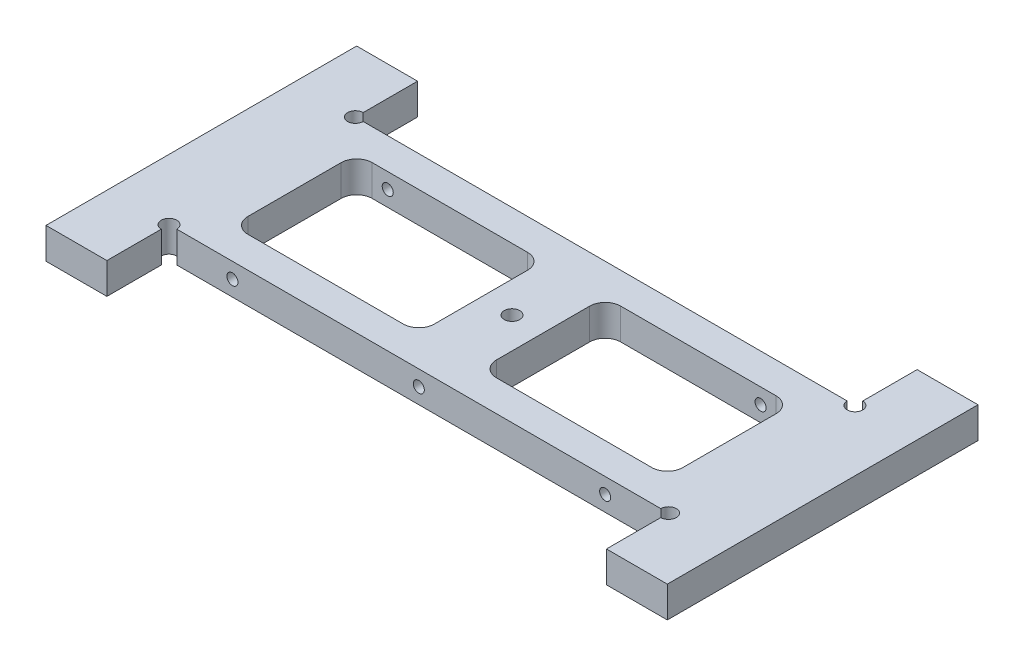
ISO-10303-21;
HEADER;
FILE_DESCRIPTION(('STEP AP214'),'2;1');
FILE_NAME('part.step','',(''),(''),'','','');
FILE_SCHEMA(('AUTOMOTIVE_DESIGN { 1 0 10303 214 1 1 1 1 }'));
ENDSEC;
DATA;
#1=APPLICATION_CONTEXT('core data for automotive mechanical design processes');
#2=APPLICATION_PROTOCOL_DEFINITION('international standard','automotive_design',2000,#1);
#3=PRODUCT_CONTEXT('',#1,'mechanical');
#4=PRODUCT('Part','Part','',(#3));
#5=PRODUCT_RELATED_PRODUCT_CATEGORY('part','',(#4));
#6=PRODUCT_DEFINITION_FORMATION('','',#4);
#7=PRODUCT_DEFINITION_CONTEXT('part definition',#1,'design');
#8=PRODUCT_DEFINITION('design','',#6,#7);
#9=PRODUCT_DEFINITION_SHAPE('','',#8);
#10=(LENGTH_UNIT() NAMED_UNIT(*) SI_UNIT(.MILLI.,.METRE.));
#11=(NAMED_UNIT(*) PLANE_ANGLE_UNIT() SI_UNIT($,.RADIAN.));
#12=(NAMED_UNIT(*) SI_UNIT($,.STERADIAN.) SOLID_ANGLE_UNIT());
#13=UNCERTAINTY_MEASURE_WITH_UNIT(LENGTH_MEASURE(1.E-05),#10,'distance_accuracy_value','');
#14=(GEOMETRIC_REPRESENTATION_CONTEXT(3) GLOBAL_UNCERTAINTY_ASSIGNED_CONTEXT((#13)) GLOBAL_UNIT_ASSIGNED_CONTEXT((#10,
#11,#12)) REPRESENTATION_CONTEXT('',''));
#15=CARTESIAN_POINT('',(0.,0.,0.));
#16=DIRECTION('',(0.,0.,1.));
#17=DIRECTION('',(1.,0.,0.));
#18=AXIS2_PLACEMENT_3D('',#15,#16,#17);
#19=CARTESIAN_POINT('',(38.1000000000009,0.,19.05));
#20=DIRECTION('',(0.,0.,1.));
#21=DIRECTION('',(1.,0.,0.));
#22=AXIS2_PLACEMENT_3D('',#19,#20,#21);
#23=CYLINDRICAL_SURFACE('',#22,1.13029999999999);
#24=CARTESIAN_POINT('',(38.1,0.,-12.7000000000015));
#25=DIRECTION('',(0.,0.,-1.));
#26=DIRECTION('',(-1.,0.,0.));
#27=AXIS2_PLACEMENT_3D('',#24,#25,#26);
#28=CIRCLE('',#27,1.13029999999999);
#29=CARTESIAN_POINT('',(36.9697,0.,-12.7000000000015));
#30=VERTEX_POINT('',#29);
#31=EDGE_CURVE('E545',#30,#30,#28,.F.);
#32=ORIENTED_EDGE('',*,*,#31,.T.);
#33=EDGE_LOOP('',(#32));
#34=FACE_BOUND('',#33,.T.);
#35=CARTESIAN_POINT('',(38.1,0.,-19.0499999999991));
#36=DIRECTION('',(0.,0.,1.));
#37=DIRECTION('',(1.,0.,0.));
#38=AXIS2_PLACEMENT_3D('',#35,#36,#37);
#39=CIRCLE('',#38,1.13029999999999);
#40=CARTESIAN_POINT('',(39.2303,0.,-19.0499999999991));
#41=VERTEX_POINT('',#40);
#42=EDGE_CURVE('E300',#41,#41,#39,.T.);
#43=ORIENTED_EDGE('',*,*,#42,.F.);
#44=EDGE_LOOP('',(#43));
#45=FACE_BOUND('',#44,.T.);
#46=ADVANCED_FACE('F38',(#34,#45),#23,.F.);
#47=CARTESIAN_POINT('',(-38.1,0.,19.05));
#48=DIRECTION('',(0.,0.,1.));
#49=DIRECTION('',(1.,0.,0.));
#50=AXIS2_PLACEMENT_3D('',#47,#48,#49);
#51=CYLINDRICAL_SURFACE('',#50,1.13029999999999);
#52=CARTESIAN_POINT('',(-38.0999999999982,0.,-12.6999999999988));
#53=DIRECTION('',(0.,0.,-1.));
#54=DIRECTION('',(-1.,0.,0.));
#55=AXIS2_PLACEMENT_3D('',#52,#53,#54);
#56=CIRCLE('',#55,1.13029999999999);
#57=CARTESIAN_POINT('',(-39.2302999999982,0.,-12.6999999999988));
#58=VERTEX_POINT('',#57);
#59=EDGE_CURVE('E269',#58,#58,#56,.F.);
#60=ORIENTED_EDGE('',*,*,#59,.T.);
#61=EDGE_LOOP('',(#60));
#62=FACE_BOUND('',#61,.T.);
#63=CARTESIAN_POINT('',(-38.1,0.,-19.05));
#64=DIRECTION('',(0.,0.,1.));
#65=DIRECTION('',(1.,0.,0.));
#66=AXIS2_PLACEMENT_3D('',#63,#64,#65);
#67=CIRCLE('',#66,1.13029999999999);
#68=CARTESIAN_POINT('',(-36.9697,0.,-19.05));
#69=VERTEX_POINT('',#68);
#70=EDGE_CURVE('E350',#69,#69,#67,.T.);
#71=ORIENTED_EDGE('',*,*,#70,.F.);
#72=EDGE_LOOP('',(#71));
#73=FACE_BOUND('',#72,.T.);
#74=ADVANCED_FACE('F388',(#62,#73),#51,.F.);
#75=CARTESIAN_POINT('',(1.77635683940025E-12,0.,19.0500000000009));
#76=DIRECTION('',(0.,0.,1.));
#77=DIRECTION('',(1.,0.,0.));
#78=AXIS2_PLACEMENT_3D('',#75,#76,#77);
#79=CYLINDRICAL_SURFACE('',#78,1.13029999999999);
#80=CARTESIAN_POINT('',(1.13029999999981,0.,-1.11470989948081));
#81=CARTESIAN_POINT('',(1.13030044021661,0.0539159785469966,-1.11470937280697));
#82=CARTESIAN_POINT('',(1.12640647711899,0.107829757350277,-1.1186990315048));
#83=CARTESIAN_POINT('',(1.11122004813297,0.213635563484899,-1.13377793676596));
#84=CARTESIAN_POINT('',(1.09990973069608,0.265522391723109,-1.14488431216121));
#85=CARTESIAN_POINT('',(1.07088733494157,0.365312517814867,-1.17206740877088));
#86=CARTESIAN_POINT('',(1.05325102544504,0.413255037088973,-1.18808499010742));
#87=CARTESIAN_POINT('',(1.01228225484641,0.505376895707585,-1.22317967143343));
#88=CARTESIAN_POINT('',(0.988949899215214,0.549556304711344,-1.24225671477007));
#89=CARTESIAN_POINT('',(0.932304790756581,0.641735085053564,-1.28547751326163));
#90=CARTESIAN_POINT('',(0.89794736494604,0.68895707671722,-1.30991008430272));
#91=CARTESIAN_POINT('',(0.822323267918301,0.777665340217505,-1.35866518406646));
#92=CARTESIAN_POINT('',(0.78104756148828,0.819143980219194,-1.38298752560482));
#93=CARTESIAN_POINT('',(0.684088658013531,0.902423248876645,-1.43376201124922));
#94=CARTESIAN_POINT('',(0.627148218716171,0.943009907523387,-1.45984198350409));
#95=CARTESIAN_POINT('',(0.50505017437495,1.01362988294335,-1.5064270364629));
#96=CARTESIAN_POINT('',(0.439910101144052,1.04368521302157,-1.52694372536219));
#97=CARTESIAN_POINT('',(0.322232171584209,1.08465876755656,-1.55528523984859));
#98=CARTESIAN_POINT('',(0.271196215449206,1.0985712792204,-1.56505117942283));
#99=CARTESIAN_POINT('',(0.166998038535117,1.11915236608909,-1.57956498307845));
#100=CARTESIAN_POINT('',(0.113837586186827,1.12582684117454,-1.58431693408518));
#101=CARTESIAN_POINT('',(0.00678446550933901,1.13155276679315,-1.58839095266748));
#102=CARTESIAN_POINT('',(-0.0471094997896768,1.13058827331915,-1.58770166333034));
#103=CARTESIAN_POINT('',(-0.153878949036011,1.12105912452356,-1.58093031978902));
#104=CARTESIAN_POINT('',(-0.206754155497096,1.11249242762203,-1.57484681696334));
#105=CARTESIAN_POINT('',(-0.308683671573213,1.08856138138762,-1.5580353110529));
#106=CARTESIAN_POINT('',(-0.357800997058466,1.07337571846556,-1.5474295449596));
#107=CARTESIAN_POINT('',(-0.452670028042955,1.03694394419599,-1.52238506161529));
#108=CARTESIAN_POINT('',(-0.498421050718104,1.01569660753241,-1.50794556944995));
#109=CARTESIAN_POINT('',(-0.590810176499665,0.965191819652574,-1.47437354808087));
#110=CARTESIAN_POINT('',(-0.636977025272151,0.935304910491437,-1.45489704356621));
#111=CARTESIAN_POINT('',(-0.723908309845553,0.869772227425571,-1.41365940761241));
#112=CARTESIAN_POINT('',(-0.764667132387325,0.83412055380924,-1.39189594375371));
#113=CARTESIAN_POINT('',(-0.847440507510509,0.750657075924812,-1.34339155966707));
#114=CARTESIAN_POINT('',(-0.888312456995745,0.701814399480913,-1.31647023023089));
#115=CARTESIAN_POINT('',(-0.96159354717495,0.597477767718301,-1.26393143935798));
#116=CARTESIAN_POINT('',(-0.994003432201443,0.541984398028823,-1.23831386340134));
#117=CARTESIAN_POINT('',(-1.04319356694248,0.437994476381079,-1.19695168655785));
#118=CARTESIAN_POINT('',(-1.06185117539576,0.390759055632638,-1.18028499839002));
#119=CARTESIAN_POINT('',(-1.09287902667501,0.292944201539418,-1.15161610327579));
#120=CARTESIAN_POINT('',(-1.10526094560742,0.242371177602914,-1.13960524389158));
#121=CARTESIAN_POINT('',(-1.12306821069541,0.138235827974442,-1.12206988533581));
#122=CARTESIAN_POINT('',(-1.12841299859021,0.08464608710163,-1.11662055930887));
#123=CARTESIAN_POINT('',(-1.13134507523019,-0.0229548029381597,-1.11365261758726));
#124=CARTESIAN_POINT('',(-1.12893741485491,-0.0769656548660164,-1.11612883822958));
#125=CARTESIAN_POINT('',(-1.11759749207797,-0.174943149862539,-1.12746454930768));
#126=CARTESIAN_POINT('',(-1.10973405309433,-0.219169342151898,-1.13527547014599));
#127=CARTESIAN_POINT('',(-1.08913347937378,-0.305515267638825,-1.15505345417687));
#128=CARTESIAN_POINT('',(-1.07639071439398,-0.347632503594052,-1.16702531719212));
#129=CARTESIAN_POINT('',(-1.03935488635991,-0.448840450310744,-1.20032196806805));
#130=CARTESIAN_POINT('',(-1.01245280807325,-0.506402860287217,-1.22338040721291));
#131=CARTESIAN_POINT('',(-0.950157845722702,-0.615413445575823,-1.2723728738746));
#132=CARTESIAN_POINT('',(-0.914748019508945,-0.666849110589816,-1.29831258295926));
#133=CARTESIAN_POINT('',(-0.835170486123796,-0.764269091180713,-1.35091587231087));
#134=CARTESIAN_POINT('',(-0.790826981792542,-0.810108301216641,-1.37758280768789));
#135=CARTESIAN_POINT('',(-0.694352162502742,-0.894167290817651,-1.42863670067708));
#136=CARTESIAN_POINT('',(-0.642231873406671,-0.932397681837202,-1.45302680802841));
#137=CARTESIAN_POINT('',(-0.539190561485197,-0.994945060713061,-1.49399656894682));
#138=CARTESIAN_POINT('',(-0.489266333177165,-1.02048954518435,-1.51119914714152));
#139=CARTESIAN_POINT('',(-0.38500036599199,-1.06420949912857,-1.54105948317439));
#140=CARTESIAN_POINT('',(-0.33066119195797,-1.08238921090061,-1.55371985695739));
#141=CARTESIAN_POINT('',(-0.21850038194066,-1.11049336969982,-1.57342686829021));
#142=CARTESIAN_POINT('',(-0.160659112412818,-1.12036553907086,-1.58043794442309));
#143=CARTESIAN_POINT('',(-0.0437312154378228,-1.13097560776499,-1.58797642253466));
#144=CARTESIAN_POINT('',(0.0153547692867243,-1.13171811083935,-1.58850709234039));
#145=CARTESIAN_POINT('',(0.126381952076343,-1.12444239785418,-1.58333344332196));
#146=CARTESIAN_POINT('',(0.178418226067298,-1.11734187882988,-1.5782822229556));
#147=CARTESIAN_POINT('',(0.280345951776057,-1.09621810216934,-1.56339892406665));
#148=CARTESIAN_POINT('',(0.330237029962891,-1.08219364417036,-1.5535660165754));
#149=CARTESIAN_POINT('',(0.427998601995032,-1.04745254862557,-1.52956639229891));
#150=CARTESIAN_POINT('',(0.475785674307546,-1.02657509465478,-1.51529601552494));
#151=CARTESIAN_POINT('',(0.567191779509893,-0.9790446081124,-1.4835075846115));
#152=CARTESIAN_POINT('',(0.610810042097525,-0.952390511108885,-1.46598893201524));
#153=CARTESIAN_POINT('',(0.699849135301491,-0.889496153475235,-1.42586965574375));
#154=CARTESIAN_POINT('',(0.74450642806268,-0.852410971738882,-1.4029020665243));
#155=CARTESIAN_POINT('',(0.82739190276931,-0.772226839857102,-1.35567739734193));
#156=CARTESIAN_POINT('',(0.865607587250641,-0.729116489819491,-1.33141792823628));
#157=CARTESIAN_POINT('',(0.941141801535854,-0.629583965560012,-1.27939242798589));
#158=CARTESIAN_POINT('',(0.977204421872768,-0.572144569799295,-1.25173102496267));
#159=CARTESIAN_POINT('',(1.03903705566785,-0.45014831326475,-1.20089925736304));
#160=CARTESIAN_POINT('',(1.06482765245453,-0.385606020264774,-1.17771995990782));
#161=CARTESIAN_POINT('',(1.0994611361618,-0.267453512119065,-1.14532129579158));
#162=CARTESIAN_POINT('',(1.11093913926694,-0.215198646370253,-1.134054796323));
#163=CARTESIAN_POINT('',(1.1263474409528,-0.108624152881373,-1.11875982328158));
#164=CARTESIAN_POINT('',(1.13029955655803,-0.0543109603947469,-1.11471043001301));
#165=CARTESIAN_POINT('',(1.13029999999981,0.,-1.11470989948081));
#166=B_SPLINE_CURVE_WITH_KNOTS('',3,(#80,#81,#82,#83,#84,#85,#86,#87,#88,#89,#90,#91,#92,#93,
#94,#95,#96,#97,#98,#99,#100,#101,#102,#103,#104,#105,#106,#107,#108,#109,#110,#111,#112,#113,
#114,#115,#116,#117,#118,#119,#120,#121,#122,#123,#124,#125,#126,#127,#128,#129,#130,#131,#132,
#133,#134,#135,#136,#137,#138,#139,#140,#141,#142,#143,#144,#145,#146,#147,#148,#149,#150,#151,
#152,#153,#154,#155,#156,#157,#158,#159,#160,#161,#162,#163,#164,#165),.UNSPECIFIED.,.T.,.F.,(4,
2,2,2,2,2,2,2,2,2,2,2,2,2,2,2,2,2,2,2,2,2,2,2,2,2,2,2,2,2,2,2,2,2,2,2,2,2,2,2,2,2,4),(0.,
0.161489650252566,0.323369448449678,0.483371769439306,0.643371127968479,0.832610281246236,
1.02209853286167,1.2447476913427,1.46692863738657,1.62761675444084,1.78817379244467,
1.94906603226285,2.11000149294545,2.26683808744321,2.4237064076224,2.59808869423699,
2.77265058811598,2.9792520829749,3.18583539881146,3.34563925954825,3.50514469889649,
3.66646065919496,3.82767154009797,3.96390213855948,4.10029040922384,4.30198049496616,
4.5040756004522,4.71062415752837,4.91688260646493,5.09214551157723,5.26730731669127,
5.44356330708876,5.6197304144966,5.77727697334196,5.93485085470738,6.09642403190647,
6.25802700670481,6.44460948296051,6.63154988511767,6.85025615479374,7.06852194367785,
7.23166832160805,7.39434102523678),.UNSPECIFIED.);
#167=CARTESIAN_POINT('',(1.13029999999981,0.,-1.11470989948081));
#168=VERTEX_POINT('',#167);
#169=EDGE_CURVE('E351',#168,#168,#166,.T.);
#170=ORIENTED_EDGE('',*,*,#169,.T.);
#171=EDGE_LOOP('',(#170));
#172=FACE_BOUND('',#171,.T.);
#173=CARTESIAN_POINT('',(8.88178419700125E-13,0.,-19.0500000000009));
#174=DIRECTION('',(0.,0.,1.));
#175=DIRECTION('',(1.,0.,0.));
#176=AXIS2_PLACEMENT_3D('',#173,#174,#175);
#177=CIRCLE('',#176,1.13029999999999);
#178=CARTESIAN_POINT('',(1.13030000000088,0.,-19.0500000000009));
#179=VERTEX_POINT('',#178);
#180=EDGE_CURVE('E357',#179,#179,#177,.T.);
#181=ORIENTED_EDGE('',*,*,#180,.F.);
#182=EDGE_LOOP('',(#181));
#183=FACE_BOUND('',#182,.T.);
#184=ADVANCED_FACE('F394',(#172,#183),#79,.F.);
#185=CARTESIAN_POINT('',(-50.8000000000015,-3.17500000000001,-19.0500000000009));
#186=DIRECTION('',(0.,-1.,0.));
#187=DIRECTION('',(0.,0.,-1.));
#188=AXIS2_PLACEMENT_3D('',#185,#186,#187);
#189=PLANE('',#188);
#190=DIRECTION('',(0.,0.,-1.));
#191=VECTOR('',#190,1.);
#192=CARTESIAN_POINT('',(44.4500000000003,-3.17499999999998,-12.6999999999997));
#193=LINE('',#192,#191);
#194=CARTESIAN_POINT('',(44.4499999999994,-3.17500000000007,9.52500000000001));
#195=VERTEX_POINT('',#194);
#196=CARTESIAN_POINT('',(44.4499999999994,-3.17499999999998,-9.52499999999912));
#197=VERTEX_POINT('',#196);
#198=EDGE_CURVE('E569',#195,#197,#193,.T.);
#199=ORIENTED_EDGE('',*,*,#198,.T.);
#200=CARTESIAN_POINT('',(41.2749999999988,-3.17499999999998,-9.52500000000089));
#201=DIRECTION('',(0.,-1.,0.));
#202=DIRECTION('',(0.,0.,-1.));
#203=AXIS2_PLACEMENT_3D('',#200,#201,#202);
#204=CIRCLE('',#203,3.175);
#205=CARTESIAN_POINT('',(41.2749999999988,-3.17500000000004,-12.7000000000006));
#206=VERTEX_POINT('',#205);
#207=EDGE_CURVE('E580',#197,#206,#204,.F.);
#208=ORIENTED_EDGE('',*,*,#207,.T.);
#209=DIRECTION('',(-1.,0.,0.));
#210=VECTOR('',#209,1.);
#211=CARTESIAN_POINT('',(44.4500000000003,-3.17499999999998,-12.6999999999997));
#212=LINE('',#211,#210);
#213=CARTESIAN_POINT('',(9.52499999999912,-3.1749999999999,-12.6999999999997));
#214=VERTEX_POINT('',#213);
#215=EDGE_CURVE('E560',#206,#214,#212,.T.);
#216=ORIENTED_EDGE('',*,*,#215,.T.);
#217=CARTESIAN_POINT('',(9.52499999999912,-3.17499999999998,-9.52500000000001));
#218=DIRECTION('',(0.,-1.,0.));
#219=DIRECTION('',(0.,0.,-1.));
#220=AXIS2_PLACEMENT_3D('',#217,#218,#219);
#221=CIRCLE('',#220,3.175);
#222=CARTESIAN_POINT('',(6.34999999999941,-3.1749999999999,-9.52500000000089));
#223=VERTEX_POINT('',#222);
#224=EDGE_CURVE('E60',#214,#223,#221,.F.);
#225=ORIENTED_EDGE('',*,*,#224,.T.);
#226=DIRECTION('',(0.,0.,1.));
#227=VECTOR('',#226,1.);
#228=CARTESIAN_POINT('',(6.34999999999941,-3.17499999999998,-12.7000000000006));
#229=LINE('',#228,#227);
#230=CARTESIAN_POINT('',(6.34999999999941,-3.17499999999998,9.52500000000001));
#231=VERTEX_POINT('',#230);
#232=EDGE_CURVE('E575',#223,#231,#229,.T.);
#233=ORIENTED_EDGE('',*,*,#232,.T.);
#234=CARTESIAN_POINT('',(9.52500000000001,-3.17500000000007,9.52499999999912));
#235=DIRECTION('',(0.,-1.,0.));
#236=DIRECTION('',(0.,0.,-1.));
#237=AXIS2_PLACEMENT_3D('',#234,#235,#236);
#238=CIRCLE('',#237,3.175);
#239=CARTESIAN_POINT('',(9.52499999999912,-3.17500000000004,12.6999999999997));
#240=VERTEX_POINT('',#239);
#241=EDGE_CURVE('E593',#231,#240,#238,.F.);
#242=ORIENTED_EDGE('',*,*,#241,.T.);
#243=DIRECTION('',(1.,0.,0.));
#244=VECTOR('',#243,1.);
#245=CARTESIAN_POINT('',(44.4500000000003,-3.17500000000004,12.7000000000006));
#246=LINE('',#245,#244);
#247=CARTESIAN_POINT('',(41.2749999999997,-3.17500000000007,12.6999999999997));
#248=VERTEX_POINT('',#247);
#249=EDGE_CURVE('E572',#240,#248,#246,.T.);
#250=ORIENTED_EDGE('',*,*,#249,.T.);
#251=CARTESIAN_POINT('',(41.2749999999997,-3.17500000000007,9.52500000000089));
#252=DIRECTION('',(0.,-1.,0.));
#253=DIRECTION('',(0.,0.,-1.));
#254=AXIS2_PLACEMENT_3D('',#251,#252,#253);
#255=CIRCLE('',#254,3.175);
#256=EDGE_CURVE('E599',#248,#195,#255,.F.);
#257=ORIENTED_EDGE('',*,*,#256,.T.);
#258=EDGE_LOOP('',(#199,#208,#216,#225,#233,#242,#250,#257));
#259=FACE_BOUND('',#258,.T.);
#260=DIRECTION('',(-1.,0.,0.));
#261=VECTOR('',#260,1.);
#262=CARTESIAN_POINT('',(-44.4500000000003,-3.17500000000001,-12.7000000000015));
#263=LINE('',#262,#261);
#264=CARTESIAN_POINT('',(-9.52499999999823,-3.17499999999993,-12.6999999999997));
#265=VERTEX_POINT('',#264);
#266=CARTESIAN_POINT('',(-41.2750000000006,-3.17500000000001,-12.7000000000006));
#267=VERTEX_POINT('',#266);
#268=EDGE_CURVE('E546',#265,#267,#263,.T.);
#269=ORIENTED_EDGE('',*,*,#268,.T.);
#270=CARTESIAN_POINT('',(-41.2750000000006,-3.17499999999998,-9.52500000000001));
#271=DIRECTION('',(0.,-1.,0.));
#272=DIRECTION('',(0.,0.,-1.));
#273=AXIS2_PLACEMENT_3D('',#270,#271,#272);
#274=CIRCLE('',#273,3.175);
#275=CARTESIAN_POINT('',(-44.4500000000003,-3.17500000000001,-9.52500000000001));
#276=VERTEX_POINT('',#275);
#277=EDGE_CURVE('E11',#267,#276,#274,.F.);
#278=ORIENTED_EDGE('',*,*,#277,.T.);
#279=DIRECTION('',(0.,0.,1.));
#280=VECTOR('',#279,1.);
#281=CARTESIAN_POINT('',(-44.4500000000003,-3.17500000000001,-12.7000000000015));
#282=LINE('',#281,#280);
#283=CARTESIAN_POINT('',(-44.4500000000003,-3.17500000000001,9.52499999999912));
#284=VERTEX_POINT('',#283);
#285=EDGE_CURVE('E535',#276,#284,#282,.T.);
#286=ORIENTED_EDGE('',*,*,#285,.T.);
#287=CARTESIAN_POINT('',(-41.2750000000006,-3.17500000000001,9.52500000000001));
#288=DIRECTION('',(0.,-1.,0.));
#289=DIRECTION('',(0.,0.,-1.));
#290=AXIS2_PLACEMENT_3D('',#287,#288,#289);
#291=CIRCLE('',#290,3.175);
#292=CARTESIAN_POINT('',(-41.2749999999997,-3.17500000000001,12.7000000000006));
#293=VERTEX_POINT('',#292);
#294=EDGE_CURVE('E606',#284,#293,#291,.F.);
#295=ORIENTED_EDGE('',*,*,#294,.T.);
#296=DIRECTION('',(1.,0.,0.));
#297=VECTOR('',#296,1.);
#298=CARTESIAN_POINT('',(-44.4500000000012,-3.17500000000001,12.6999999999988));
#299=LINE('',#298,#297);
#300=CARTESIAN_POINT('',(-9.52500000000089,-3.17499999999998,12.6999999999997));
#301=VERTEX_POINT('',#300);
#302=EDGE_CURVE('E552',#293,#301,#299,.T.);
#303=ORIENTED_EDGE('',*,*,#302,.T.);
#304=CARTESIAN_POINT('',(-9.52500000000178,-3.17500000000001,9.52499999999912));
#305=DIRECTION('',(0.,-1.,0.));
#306=DIRECTION('',(0.,0.,-1.));
#307=AXIS2_PLACEMENT_3D('',#304,#305,#306);
#308=CIRCLE('',#307,3.175);
#309=CARTESIAN_POINT('',(-6.35000000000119,-3.17499999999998,9.52500000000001));
#310=VERTEX_POINT('',#309);
#311=EDGE_CURVE('E610',#301,#310,#308,.F.);
#312=ORIENTED_EDGE('',*,*,#311,.T.);
#313=DIRECTION('',(0.,0.,-1.));
#314=VECTOR('',#313,1.);
#315=CARTESIAN_POINT('',(-6.3500000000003,-3.17499999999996,-12.7000000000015));
#316=LINE('',#315,#314);
#317=CARTESIAN_POINT('',(-6.34999999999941,-3.17500000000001,-9.52500000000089));
#318=VERTEX_POINT('',#317);
#319=EDGE_CURVE('E549',#310,#318,#316,.T.);
#320=ORIENTED_EDGE('',*,*,#319,.T.);
#321=CARTESIAN_POINT('',(-9.52500000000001,-3.17499999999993,-9.52500000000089));
#322=DIRECTION('',(0.,-1.,0.));
#323=DIRECTION('',(0.,0.,-1.));
#324=AXIS2_PLACEMENT_3D('',#321,#322,#323);
#325=CIRCLE('',#324,3.175);
#326=EDGE_CURVE('E614',#318,#265,#325,.F.);
#327=ORIENTED_EDGE('',*,*,#326,.T.);
#328=EDGE_LOOP('',(#269,#278,#286,#295,#303,#312,#320,#327));
#329=FACE_BOUND('',#328,.T.);
#330=CARTESIAN_POINT('',(51.0539999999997,-3.17500000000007,-19.0499999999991));
#331=DIRECTION('',(0.,1.,0.));
#332=DIRECTION('',(0.,0.,1.));
#333=AXIS2_PLACEMENT_3D('',#330,#331,#332);
#334=CIRCLE('',#333,1.5875);
#335=CARTESIAN_POINT('',(49.4664999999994,-3.17500000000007,-19.0500000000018));
#336=VERTEX_POINT('',#335);
#337=CARTESIAN_POINT('',(51.0539999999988,-3.17500000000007,-20.6375000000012));
#338=VERTEX_POINT('',#337);
#339=EDGE_CURVE('E253',#336,#338,#334,.T.);
#340=ORIENTED_EDGE('',*,*,#339,.T.);
#341=DIRECTION('',(0.,0.,1.));
#342=VECTOR('',#341,1.);
#343=CARTESIAN_POINT('',(51.0539999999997,-3.17500000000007,-19.0499999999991));
#344=LINE('',#343,#342);
#345=CARTESIAN_POINT('',(51.0539999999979,-3.17500000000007,-31.7500000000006));
#346=VERTEX_POINT('',#345);
#347=EDGE_CURVE('E451',#346,#338,#344,.T.);
#348=ORIENTED_EDGE('',*,*,#347,.F.);
#349=DIRECTION('',(-1.,0.,0.));
#350=VECTOR('',#349,1.);
#351=CARTESIAN_POINT('',(63.4999999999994,-3.17499999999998,-31.7499999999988));
#352=LINE('',#351,#350);
#353=CARTESIAN_POINT('',(63.4999999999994,-3.17499999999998,-31.7499999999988));
#354=VERTEX_POINT('',#353);
#355=EDGE_CURVE('E482',#354,#346,#352,.T.);
#356=ORIENTED_EDGE('',*,*,#355,.F.);
#357=DIRECTION('',(0.,0.,1.));
#358=VECTOR('',#357,1.);
#359=CARTESIAN_POINT('',(63.4999999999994,-3.17499999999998,-31.7499999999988));
#360=LINE('',#359,#358);
#361=CARTESIAN_POINT('',(63.4999999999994,-3.17500000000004,31.7500000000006));
#362=VERTEX_POINT('',#361);
#363=EDGE_CURVE('E479',#354,#362,#360,.T.);
#364=ORIENTED_EDGE('',*,*,#363,.T.);
#365=DIRECTION('',(-1.,0.,0.));
#366=VECTOR('',#365,1.);
#367=CARTESIAN_POINT('',(63.4999999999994,-3.17500000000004,31.7500000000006));
#368=LINE('',#367,#366);
#369=CARTESIAN_POINT('',(51.0539999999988,-3.17500000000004,31.7499999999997));
#370=VERTEX_POINT('',#369);
#371=EDGE_CURVE('E485',#362,#370,#368,.T.);
#372=ORIENTED_EDGE('',*,*,#371,.T.);
#373=DIRECTION('',(0.,0.,1.));
#374=VECTOR('',#373,1.);
#375=CARTESIAN_POINT('',(51.0539999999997,-3.17500000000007,-19.0499999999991));
#376=LINE('',#375,#374);
#377=CARTESIAN_POINT('',(51.0539999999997,-3.17500000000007,20.6375000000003));
#378=VERTEX_POINT('',#377);
#379=EDGE_CURVE('E435',#378,#370,#376,.T.);
#380=ORIENTED_EDGE('',*,*,#379,.F.);
#381=CARTESIAN_POINT('',(51.0540000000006,-3.17500000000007,19.0499999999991));
#382=DIRECTION('',(0.,1.,0.));
#383=DIRECTION('',(0.,0.,1.));
#384=AXIS2_PLACEMENT_3D('',#381,#382,#383);
#385=CIRCLE('',#384,1.5875);
#386=CARTESIAN_POINT('',(49.4664999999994,-3.17500000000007,19.0500000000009));
#387=VERTEX_POINT('',#386);
#388=EDGE_CURVE('E433',#378,#387,#385,.T.);
#389=ORIENTED_EDGE('',*,*,#388,.T.);
#390=DIRECTION('',(1.,0.,0.));
#391=VECTOR('',#390,1.);
#392=CARTESIAN_POINT('',(-50.8000000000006,-3.17500000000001,19.05));
#393=LINE('',#392,#391);
#394=CARTESIAN_POINT('',(-49.4665000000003,-3.17499999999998,19.0499999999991));
#395=VERTEX_POINT('',#394);
#396=EDGE_CURVE('E276',#395,#387,#393,.T.);
#397=ORIENTED_EDGE('',*,*,#396,.F.);
#398=CARTESIAN_POINT('',(-51.0539999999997,-3.17499999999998,19.05));
#399=DIRECTION('',(0.,1.,0.));
#400=DIRECTION('',(0.,0.,1.));
#401=AXIS2_PLACEMENT_3D('',#398,#399,#400);
#402=CIRCLE('',#401,1.5875);
#403=CARTESIAN_POINT('',(-51.0540000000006,-3.17499999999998,20.6374999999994));
#404=VERTEX_POINT('',#403);
#405=EDGE_CURVE('E430',#395,#404,#402,.T.);
#406=ORIENTED_EDGE('',*,*,#405,.T.);
#407=DIRECTION('',(0.,0.,-1.));
#408=VECTOR('',#407,1.);
#409=CARTESIAN_POINT('',(-51.0540000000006,-3.17499999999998,-19.05));
#410=LINE('',#409,#408);
#411=CARTESIAN_POINT('',(-51.0539999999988,-3.17499999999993,31.7499999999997));
#412=VERTEX_POINT('',#411);
#413=EDGE_CURVE('E465',#412,#404,#410,.T.);
#414=ORIENTED_EDGE('',*,*,#413,.F.);
#415=DIRECTION('',(1.,0.,0.));
#416=VECTOR('',#415,1.);
#417=CARTESIAN_POINT('',(-63.5000000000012,-3.17500000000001,31.7500000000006));
#418=LINE('',#417,#416);
#419=CARTESIAN_POINT('',(-63.5000000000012,-3.17500000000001,31.7500000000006));
#420=VERTEX_POINT('',#419);
#421=EDGE_CURVE('E334',#420,#412,#418,.T.);
#422=ORIENTED_EDGE('',*,*,#421,.F.);
#423=DIRECTION('',(0.,0.,1.));
#424=VECTOR('',#423,1.);
#425=CARTESIAN_POINT('',(-63.5000000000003,-3.17499999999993,-31.7500000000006));
#426=LINE('',#425,#424);
#427=CARTESIAN_POINT('',(-63.5000000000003,-3.17499999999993,-31.7500000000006));
#428=VERTEX_POINT('',#427);
#429=EDGE_CURVE('E331',#428,#420,#426,.T.);
#430=ORIENTED_EDGE('',*,*,#429,.F.);
#431=DIRECTION('',(1.,0.,0.));
#432=VECTOR('',#431,1.);
#433=CARTESIAN_POINT('',(-63.5000000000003,-3.17499999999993,-31.7500000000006));
#434=LINE('',#433,#432);
#435=CARTESIAN_POINT('',(-51.0539999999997,-3.17500000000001,-31.7499999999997));
#436=VERTEX_POINT('',#435);
#437=EDGE_CURVE('E318',#428,#436,#434,.T.);
#438=ORIENTED_EDGE('',*,*,#437,.T.);
#439=DIRECTION('',(0.,0.,-1.));
#440=VECTOR('',#439,1.);
#441=CARTESIAN_POINT('',(-51.0540000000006,-3.17499999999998,-19.05));
#442=LINE('',#441,#440);
#443=CARTESIAN_POINT('',(-51.0539999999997,-3.17499999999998,-20.6374999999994));
#444=VERTEX_POINT('',#443);
#445=EDGE_CURVE('E329',#444,#436,#442,.T.);
#446=ORIENTED_EDGE('',*,*,#445,.F.);
#447=CARTESIAN_POINT('',(-51.0540000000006,-3.17499999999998,-19.05));
#448=DIRECTION('',(0.,1.,0.));
#449=DIRECTION('',(0.,0.,1.));
#450=AXIS2_PLACEMENT_3D('',#447,#448,#449);
#451=CIRCLE('',#450,1.5875);
#452=CARTESIAN_POINT('',(-49.4665000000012,-3.17499999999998,-19.05));
#453=VERTEX_POINT('',#452);
#454=EDGE_CURVE('E446',#444,#453,#451,.T.);
#455=ORIENTED_EDGE('',*,*,#454,.T.);
#456=DIRECTION('',(1.,0.,0.));
#457=VECTOR('',#456,1.);
#458=CARTESIAN_POINT('',(-50.8000000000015,-3.17500000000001,-19.0500000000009));
#459=LINE('',#458,#457);
#460=EDGE_CURVE('E275',#453,#336,#459,.T.);
#461=ORIENTED_EDGE('',*,*,#460,.T.);
#462=EDGE_LOOP('',(#340,#348,#356,#364,#372,#380,#389,#397,#406,#414,#422,#430,#438,#446,#455,#461));
#463=FACE_BOUND('',#462,.T.);
#464=CARTESIAN_POINT('',(-8.88178419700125E-13,-3.17499999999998,8.88178419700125E-13));
#465=DIRECTION('',(0.,1.,0.));
#466=DIRECTION('',(0.,0.,1.));
#467=AXIS2_PLACEMENT_3D('',#464,#465,#466);
#468=CIRCLE('',#467,1.5875);
#469=CARTESIAN_POINT('',(-8.88178419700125E-13,-3.17499999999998,1.58750000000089));
#470=VERTEX_POINT('',#469);
#471=EDGE_CURVE('E337',#470,#470,#468,.T.);
#472=ORIENTED_EDGE('',*,*,#471,.T.);
#473=EDGE_LOOP('',(#472));
#474=FACE_BOUND('',#473,.T.);
#475=ADVANCED_FACE('F326',(#259,#329,#463,#474),#189,.T.);
#476=CARTESIAN_POINT('',(-50.8000000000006,3.17499999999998,-19.0500000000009));
#477=DIRECTION('',(0.,1.,0.));
#478=DIRECTION('',(0.,0.,1.));
#479=AXIS2_PLACEMENT_3D('',#476,#477,#478);
#480=PLANE('',#479);
#481=DIRECTION('',(-1.,0.,0.));
#482=VECTOR('',#481,1.);
#483=CARTESIAN_POINT('',(44.4500000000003,3.17500000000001,-12.7000000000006));
#484=LINE('',#483,#482);
#485=CARTESIAN_POINT('',(41.2749999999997,3.17499999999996,-12.7000000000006));
#486=VERTEX_POINT('',#485);
#487=CARTESIAN_POINT('',(9.52500000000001,3.17500000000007,-12.6999999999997));
#488=VERTEX_POINT('',#487);
#489=EDGE_CURVE('E566',#486,#488,#484,.T.);
#490=ORIENTED_EDGE('',*,*,#489,.F.);
#491=CARTESIAN_POINT('',(41.2750000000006,3.17500000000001,-9.52499999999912));
#492=DIRECTION('',(0.,1.,0.));
#493=DIRECTION('',(0.,0.,1.));
#494=AXIS2_PLACEMENT_3D('',#491,#492,#493);
#495=CIRCLE('',#494,3.175);
#496=CARTESIAN_POINT('',(44.4500000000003,3.17500000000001,-9.52500000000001));
#497=VERTEX_POINT('',#496);
#498=EDGE_CURVE('E604',#486,#497,#495,.F.);
#499=ORIENTED_EDGE('',*,*,#498,.T.);
#500=DIRECTION('',(0.,0.,-1.));
#501=VECTOR('',#500,1.);
#502=CARTESIAN_POINT('',(44.4500000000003,3.17500000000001,-12.7000000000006));
#503=LINE('',#502,#501);
#504=CARTESIAN_POINT('',(44.4499999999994,3.17499999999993,9.52499999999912));
#505=VERTEX_POINT('',#504);
#506=EDGE_CURVE('E557',#505,#497,#503,.T.);
#507=ORIENTED_EDGE('',*,*,#506,.F.);
#508=CARTESIAN_POINT('',(41.2749999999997,3.17499999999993,9.52500000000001));
#509=DIRECTION('',(0.,1.,0.));
#510=DIRECTION('',(0.,0.,1.));
#511=AXIS2_PLACEMENT_3D('',#508,#509,#510);
#512=CIRCLE('',#511,3.175);
#513=CARTESIAN_POINT('',(41.2749999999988,3.17499999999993,12.6999999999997));
#514=VERTEX_POINT('',#513);
#515=EDGE_CURVE('E601',#505,#514,#512,.F.);
#516=ORIENTED_EDGE('',*,*,#515,.T.);
#517=DIRECTION('',(1.,0.,0.));
#518=VECTOR('',#517,1.);
#519=CARTESIAN_POINT('',(44.4499999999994,3.17499999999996,12.6999999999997));
#520=LINE('',#519,#518);
#521=CARTESIAN_POINT('',(9.52500000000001,3.17499999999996,12.6999999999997));
#522=VERTEX_POINT('',#521);
#523=EDGE_CURVE('E561',#522,#514,#520,.T.);
#524=ORIENTED_EDGE('',*,*,#523,.F.);
#525=CARTESIAN_POINT('',(9.52500000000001,3.17499999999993,9.52500000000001));
#526=DIRECTION('',(0.,1.,0.));
#527=DIRECTION('',(0.,0.,1.));
#528=AXIS2_PLACEMENT_3D('',#525,#526,#527);
#529=CIRCLE('',#528,3.175);
#530=CARTESIAN_POINT('',(6.34999999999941,3.17500000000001,9.52500000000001));
#531=VERTEX_POINT('',#530);
#532=EDGE_CURVE('E597',#522,#531,#529,.F.);
#533=ORIENTED_EDGE('',*,*,#532,.T.);
#534=DIRECTION('',(0.,0.,1.));
#535=VECTOR('',#534,1.);
#536=CARTESIAN_POINT('',(6.34999999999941,3.17500000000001,-12.6999999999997));
#537=LINE('',#536,#535);
#538=CARTESIAN_POINT('',(6.35000000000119,3.17500000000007,-9.52499999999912));
#539=VERTEX_POINT('',#538);
#540=EDGE_CURVE('E564',#539,#531,#537,.T.);
#541=ORIENTED_EDGE('',*,*,#540,.F.);
#542=CARTESIAN_POINT('',(9.52499999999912,3.17500000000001,-9.52500000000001));
#543=DIRECTION('',(0.,1.,0.));
#544=DIRECTION('',(0.,0.,1.));
#545=AXIS2_PLACEMENT_3D('',#542,#543,#544);
#546=CIRCLE('',#545,3.175);
#547=EDGE_CURVE('E591',#539,#488,#546,.F.);
#548=ORIENTED_EDGE('',*,*,#547,.T.);
#549=EDGE_LOOP('',(#490,#499,#507,#516,#524,#533,#541,#548));
#550=FACE_BOUND('',#549,.T.);
#551=DIRECTION('',(0.,0.,1.));
#552=VECTOR('',#551,1.);
#553=CARTESIAN_POINT('',(-44.4500000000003,3.17499999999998,-12.6999999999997));
#554=LINE('',#553,#552);
#555=CARTESIAN_POINT('',(-44.4500000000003,3.17499999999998,-9.52500000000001));
#556=VERTEX_POINT('',#555);
#557=CARTESIAN_POINT('',(-44.4500000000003,3.17499999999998,9.52500000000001));
#558=VERTEX_POINT('',#557);
#559=EDGE_CURVE('E542',#556,#558,#554,.T.);
#560=ORIENTED_EDGE('',*,*,#559,.F.);
#561=CARTESIAN_POINT('',(-41.2749999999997,3.17500000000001,-9.52500000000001));
#562=DIRECTION('',(0.,1.,0.));
#563=DIRECTION('',(0.,0.,1.));
#564=AXIS2_PLACEMENT_3D('',#561,#562,#563);
#565=CIRCLE('',#564,3.175);
#566=CARTESIAN_POINT('',(-41.2749999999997,3.17499999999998,-12.7000000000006));
#567=VERTEX_POINT('',#566);
#568=EDGE_CURVE('E46',#556,#567,#565,.F.);
#569=ORIENTED_EDGE('',*,*,#568,.T.);
#570=DIRECTION('',(-1.,0.,0.));
#571=VECTOR('',#570,1.);
#572=CARTESIAN_POINT('',(-44.4500000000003,3.17499999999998,-12.6999999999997));
#573=LINE('',#572,#571);
#574=CARTESIAN_POINT('',(-9.52500000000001,3.17500000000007,-12.7000000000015));
#575=VERTEX_POINT('',#574);
#576=EDGE_CURVE('E532',#575,#567,#573,.T.);
#577=ORIENTED_EDGE('',*,*,#576,.F.);
#578=CARTESIAN_POINT('',(-9.52499999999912,3.17500000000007,-9.52500000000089));
#579=DIRECTION('',(0.,1.,0.));
#580=DIRECTION('',(0.,0.,1.));
#581=AXIS2_PLACEMENT_3D('',#578,#579,#580);
#582=CIRCLE('',#581,3.175);
#583=CARTESIAN_POINT('',(-6.34999999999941,3.17499999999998,-9.52500000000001));
#584=VERTEX_POINT('',#583);
#585=EDGE_CURVE('E616',#575,#584,#582,.F.);
#586=ORIENTED_EDGE('',*,*,#585,.T.);
#587=DIRECTION('',(0.,0.,-1.));
#588=VECTOR('',#587,1.);
#589=CARTESIAN_POINT('',(-6.34999999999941,3.17500000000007,-12.7000000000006));
#590=LINE('',#589,#588);
#591=CARTESIAN_POINT('',(-6.3500000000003,3.17499999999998,9.52500000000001));
#592=VERTEX_POINT('',#591);
#593=EDGE_CURVE('E536',#592,#584,#590,.T.);
#594=ORIENTED_EDGE('',*,*,#593,.F.);
#595=CARTESIAN_POINT('',(-9.52500000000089,3.17499999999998,9.52500000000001));
#596=DIRECTION('',(0.,1.,0.));
#597=DIRECTION('',(0.,0.,1.));
#598=AXIS2_PLACEMENT_3D('',#595,#596,#597);
#599=CIRCLE('',#598,3.175);
#600=CARTESIAN_POINT('',(-9.52500000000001,3.17499999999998,12.7000000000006));
#601=VERTEX_POINT('',#600);
#602=EDGE_CURVE('E612',#592,#601,#599,.F.);
#603=ORIENTED_EDGE('',*,*,#602,.T.);
#604=DIRECTION('',(1.,0.,0.));
#605=VECTOR('',#604,1.);
#606=CARTESIAN_POINT('',(-44.4500000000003,3.17499999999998,12.6999999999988));
#607=LINE('',#606,#605);
#608=CARTESIAN_POINT('',(-41.2749999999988,3.17499999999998,12.7000000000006));
#609=VERTEX_POINT('',#608);
#610=EDGE_CURVE('E539',#609,#601,#607,.T.);
#611=ORIENTED_EDGE('',*,*,#610,.F.);
#612=CARTESIAN_POINT('',(-41.2750000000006,3.17499999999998,9.52500000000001));
#613=DIRECTION('',(0.,1.,0.));
#614=DIRECTION('',(0.,0.,1.));
#615=AXIS2_PLACEMENT_3D('',#612,#613,#614);
#616=CIRCLE('',#615,3.175);
#617=EDGE_CURVE('E608',#609,#558,#616,.F.);
#618=ORIENTED_EDGE('',*,*,#617,.T.);
#619=EDGE_LOOP('',(#560,#569,#577,#586,#594,#603,#611,#618));
#620=FACE_BOUND('',#619,.T.);
#621=CARTESIAN_POINT('',(51.0539999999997,3.17499999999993,-19.0500000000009));
#622=DIRECTION('',(0.,1.,0.));
#623=DIRECTION('',(0.,0.,1.));
#624=AXIS2_PLACEMENT_3D('',#621,#622,#623);
#625=CIRCLE('',#624,1.5875);
#626=CARTESIAN_POINT('',(49.4664999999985,3.17499999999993,-19.0500000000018));
#627=VERTEX_POINT('',#626);
#628=CARTESIAN_POINT('',(51.0539999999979,3.17499999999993,-20.6375000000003));
#629=VERTEX_POINT('',#628);
#630=EDGE_CURVE('E250',#627,#629,#625,.T.);
#631=ORIENTED_EDGE('',*,*,#630,.F.);
#632=DIRECTION('',(-1.,0.,0.));
#633=VECTOR('',#632,1.);
#634=CARTESIAN_POINT('',(-50.8000000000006,3.17499999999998,-19.0500000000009));
#635=LINE('',#634,#633);
#636=CARTESIAN_POINT('',(-49.4665000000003,3.17500000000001,-19.05));
#637=VERTEX_POINT('',#636);
#638=EDGE_CURVE('E265',#627,#637,#635,.T.);
#639=ORIENTED_EDGE('',*,*,#638,.T.);
#640=CARTESIAN_POINT('',(-51.0539999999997,3.17500000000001,-19.05));
#641=DIRECTION('',(0.,1.,0.));
#642=DIRECTION('',(0.,0.,1.));
#643=AXIS2_PLACEMENT_3D('',#640,#641,#642);
#644=CIRCLE('',#643,1.5875);
#645=CARTESIAN_POINT('',(-51.0540000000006,3.17500000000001,-20.6375000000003));
#646=VERTEX_POINT('',#645);
#647=EDGE_CURVE('E445',#646,#637,#644,.T.);
#648=ORIENTED_EDGE('',*,*,#647,.F.);
#649=DIRECTION('',(0.,0.,1.));
#650=VECTOR('',#649,1.);
#651=CARTESIAN_POINT('',(-51.0539999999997,3.17500000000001,-19.05));
#652=LINE('',#651,#650);
#653=CARTESIAN_POINT('',(-51.0540000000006,3.17499999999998,-31.7500000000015));
#654=VERTEX_POINT('',#653);
#655=EDGE_CURVE('E467',#654,#646,#652,.T.);
#656=ORIENTED_EDGE('',*,*,#655,.F.);
#657=DIRECTION('',(1.,0.,0.));
#658=VECTOR('',#657,1.);
#659=CARTESIAN_POINT('',(-63.5000000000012,3.17500000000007,-31.7499999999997));
#660=LINE('',#659,#658);
#661=CARTESIAN_POINT('',(-63.5000000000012,3.17500000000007,-31.7499999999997));
#662=VERTEX_POINT('',#661);
#663=EDGE_CURVE('E320',#662,#654,#660,.T.);
#664=ORIENTED_EDGE('',*,*,#663,.F.);
#665=DIRECTION('',(0.,0.,-1.));
#666=VECTOR('',#665,1.);
#667=CARTESIAN_POINT('',(-63.5000000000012,3.17500000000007,-31.7499999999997));
#668=LINE('',#667,#666);
#669=CARTESIAN_POINT('',(-63.5000000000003,3.17499999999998,31.7500000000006));
#670=VERTEX_POINT('',#669);
#671=EDGE_CURVE('E497',#670,#662,#668,.T.);
#672=ORIENTED_EDGE('',*,*,#671,.F.);
#673=DIRECTION('',(1.,0.,0.));
#674=VECTOR('',#673,1.);
#675=CARTESIAN_POINT('',(-63.5000000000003,3.17499999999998,31.7500000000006));
#676=LINE('',#675,#674);
#677=CARTESIAN_POINT('',(-51.0540000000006,3.17500000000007,31.7500000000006));
#678=VERTEX_POINT('',#677);
#679=EDGE_CURVE('E340',#670,#678,#676,.T.);
#680=ORIENTED_EDGE('',*,*,#679,.T.);
#681=DIRECTION('',(0.,0.,1.));
#682=VECTOR('',#681,1.);
#683=CARTESIAN_POINT('',(-51.0540000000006,3.17500000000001,19.0499999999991));
#684=LINE('',#683,#682);
#685=CARTESIAN_POINT('',(-51.0539999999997,3.17500000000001,20.6374999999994));
#686=VERTEX_POINT('',#685);
#687=EDGE_CURVE('E460',#686,#678,#684,.T.);
#688=ORIENTED_EDGE('',*,*,#687,.F.);
#689=CARTESIAN_POINT('',(-51.0540000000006,3.17500000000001,19.0499999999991));
#690=DIRECTION('',(0.,1.,0.));
#691=DIRECTION('',(0.,0.,1.));
#692=AXIS2_PLACEMENT_3D('',#689,#690,#691);
#693=CIRCLE('',#692,1.5875);
#694=CARTESIAN_POINT('',(-49.4665000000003,3.17500000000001,19.05));
#695=VERTEX_POINT('',#694);
#696=EDGE_CURVE('E438',#695,#686,#693,.T.);
#697=ORIENTED_EDGE('',*,*,#696,.F.);
#698=DIRECTION('',(-1.,0.,0.));
#699=VECTOR('',#698,1.);
#700=CARTESIAN_POINT('',(-50.8000000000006,3.17499999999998,19.0499999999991));
#701=LINE('',#700,#699);
#702=CARTESIAN_POINT('',(49.4664999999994,3.17499999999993,19.0499999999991));
#703=VERTEX_POINT('',#702);
#704=EDGE_CURVE('E281',#703,#695,#701,.T.);
#705=ORIENTED_EDGE('',*,*,#704,.F.);
#706=CARTESIAN_POINT('',(51.0539999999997,3.17499999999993,19.0499999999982));
#707=DIRECTION('',(0.,1.,0.));
#708=DIRECTION('',(0.,0.,1.));
#709=AXIS2_PLACEMENT_3D('',#706,#707,#708);
#710=CIRCLE('',#709,1.5875);
#711=CARTESIAN_POINT('',(51.0539999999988,3.17499999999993,20.6374999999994));
#712=VERTEX_POINT('',#711);
#713=EDGE_CURVE('E258',#712,#703,#710,.T.);
#714=ORIENTED_EDGE('',*,*,#713,.F.);
#715=DIRECTION('',(0.,0.,-1.));
#716=VECTOR('',#715,1.);
#717=CARTESIAN_POINT('',(51.0539999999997,3.17499999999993,19.0499999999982));
#718=LINE('',#717,#716);
#719=CARTESIAN_POINT('',(51.0539999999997,3.17499999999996,31.7499999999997));
#720=VERTEX_POINT('',#719);
#721=EDGE_CURVE('E454',#720,#712,#718,.T.);
#722=ORIENTED_EDGE('',*,*,#721,.F.);
#723=DIRECTION('',(-1.,0.,0.));
#724=VECTOR('',#723,1.);
#725=CARTESIAN_POINT('',(63.4999999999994,3.17499999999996,31.7499999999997));
#726=LINE('',#725,#724);
#727=CARTESIAN_POINT('',(63.4999999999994,3.17499999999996,31.7499999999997));
#728=VERTEX_POINT('',#727);
#729=EDGE_CURVE('E487',#728,#720,#726,.T.);
#730=ORIENTED_EDGE('',*,*,#729,.F.);
#731=DIRECTION('',(0.,0.,-1.));
#732=VECTOR('',#731,1.);
#733=CARTESIAN_POINT('',(63.4999999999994,3.17500000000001,-31.7500000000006));
#734=LINE('',#733,#732);
#735=CARTESIAN_POINT('',(63.4999999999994,3.17500000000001,-31.7500000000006));
#736=VERTEX_POINT('',#735);
#737=EDGE_CURVE('E473',#728,#736,#734,.T.);
#738=ORIENTED_EDGE('',*,*,#737,.T.);
#739=DIRECTION('',(-1.,0.,0.));
#740=VECTOR('',#739,1.);
#741=CARTESIAN_POINT('',(63.4999999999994,3.17500000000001,-31.7500000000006));
#742=LINE('',#741,#740);
#743=CARTESIAN_POINT('',(51.0539999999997,3.17499999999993,-31.7499999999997));
#744=VERTEX_POINT('',#743);
#745=EDGE_CURVE('E490',#736,#744,#742,.T.);
#746=ORIENTED_EDGE('',*,*,#745,.T.);
#747=DIRECTION('',(0.,0.,-1.));
#748=VECTOR('',#747,1.);
#749=CARTESIAN_POINT('',(51.0539999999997,3.17499999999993,-19.0500000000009));
#750=LINE('',#749,#748);
#751=EDGE_CURVE('E268',#629,#744,#750,.T.);
#752=ORIENTED_EDGE('',*,*,#751,.F.);
#753=EDGE_LOOP('',(#631,#639,#648,#656,#664,#672,#680,#688,#697,#705,#714,#722,#730,#738,#746,#752));
#754=FACE_BOUND('',#753,.T.);
#755=CARTESIAN_POINT('',(0.,3.17500000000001,8.88178419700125E-13));
#756=DIRECTION('',(0.,1.,0.));
#757=DIRECTION('',(0.,0.,1.));
#758=AXIS2_PLACEMENT_3D('',#755,#756,#757);
#759=CIRCLE('',#758,1.58749999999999);
#760=CARTESIAN_POINT('',(0.,3.17500000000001,1.58750000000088));
#761=VERTEX_POINT('',#760);
#762=EDGE_CURVE('E333',#761,#761,#759,.T.);
#763=ORIENTED_EDGE('',*,*,#762,.F.);
#764=EDGE_LOOP('',(#763));
#765=FACE_BOUND('',#764,.T.);
#766=ADVANCED_FACE('F262',(#550,#620,#754,#765),#480,.T.);
#767=CARTESIAN_POINT('',(50.7999999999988,3.17500000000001,-19.0499999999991));
#768=DIRECTION('',(0.,0.,-1.));
#769=DIRECTION('',(-1.,0.,0.));
#770=AXIS2_PLACEMENT_3D('',#767,#768,#769);
#771=PLANE('',#770);
#772=DIRECTION('',(0.,1.,0.));
#773=VECTOR('',#772,1.);
#774=CARTESIAN_POINT('',(49.4664999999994,-3.17500000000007,-19.0500000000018));
#775=LINE('',#774,#773);
#776=EDGE_CURVE('E247',#336,#627,#775,.T.);
#777=ORIENTED_EDGE('',*,*,#776,.F.);
#778=ORIENTED_EDGE('',*,*,#460,.F.);
#779=DIRECTION('',(0.,1.,0.));
#780=VECTOR('',#779,1.);
#781=CARTESIAN_POINT('',(-49.4665000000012,-3.17499999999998,-19.05));
#782=LINE('',#781,#780);
#783=EDGE_CURVE('E274',#637,#453,#782,.F.);
#784=ORIENTED_EDGE('',*,*,#783,.F.);
#785=ORIENTED_EDGE('',*,*,#638,.F.);
#786=EDGE_LOOP('',(#777,#778,#784,#785));
#787=FACE_BOUND('',#786,.T.);
#788=ORIENTED_EDGE('',*,*,#70,.T.);
#789=EDGE_LOOP('',(#788));
#790=FACE_BOUND('',#789,.T.);
#791=ORIENTED_EDGE('',*,*,#180,.T.);
#792=EDGE_LOOP('',(#791));
#793=FACE_BOUND('',#792,.T.);
#794=ORIENTED_EDGE('',*,*,#42,.T.);
#795=EDGE_LOOP('',(#794));
#796=FACE_BOUND('',#795,.T.);
#797=ADVANCED_FACE('F272',(#787,#790,#793,#796),#771,.T.);
#798=CARTESIAN_POINT('',(50.7999999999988,3.17500000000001,19.05));
#799=DIRECTION('',(0.,0.,-1.));
#800=DIRECTION('',(-1.,0.,0.));
#801=AXIS2_PLACEMENT_3D('',#798,#799,#800);
#802=PLANE('',#801);
#803=CARTESIAN_POINT('',(-38.1,0.,19.05));
#804=DIRECTION('',(0.,0.,1.));
#805=DIRECTION('',(1.,0.,0.));
#806=AXIS2_PLACEMENT_3D('',#803,#804,#805);
#807=CIRCLE('',#806,1.13029999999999);
#808=CARTESIAN_POINT('',(-36.9697,0.,19.05));
#809=VERTEX_POINT('',#808);
#810=EDGE_CURVE('E347',#809,#809,#807,.T.);
#811=ORIENTED_EDGE('',*,*,#810,.F.);
#812=EDGE_LOOP('',(#811));
#813=FACE_BOUND('',#812,.T.);
#814=CARTESIAN_POINT('',(1.77635683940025E-12,0.,19.0500000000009));
#815=DIRECTION('',(0.,0.,1.));
#816=DIRECTION('',(1.,0.,0.));
#817=AXIS2_PLACEMENT_3D('',#814,#815,#816);
#818=CIRCLE('',#817,1.13029999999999);
#819=CARTESIAN_POINT('',(1.13030000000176,0.,19.0500000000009));
#820=VERTEX_POINT('',#819);
#821=EDGE_CURVE('E354',#820,#820,#818,.T.);
#822=ORIENTED_EDGE('',*,*,#821,.F.);
#823=EDGE_LOOP('',(#822));
#824=FACE_BOUND('',#823,.T.);
#825=CARTESIAN_POINT('',(38.1000000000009,0.,19.05));
#826=DIRECTION('',(0.,0.,1.));
#827=DIRECTION('',(1.,0.,0.));
#828=AXIS2_PLACEMENT_3D('',#825,#826,#827);
#829=CIRCLE('',#828,1.13029999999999);
#830=CARTESIAN_POINT('',(39.2303000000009,0.,19.05));
#831=VERTEX_POINT('',#830);
#832=EDGE_CURVE('E360',#831,#831,#829,.T.);
#833=ORIENTED_EDGE('',*,*,#832,.F.);
#834=EDGE_LOOP('',(#833));
#835=FACE_BOUND('',#834,.T.);
#836=ORIENTED_EDGE('',*,*,#396,.T.);
#837=DIRECTION('',(0.,1.,0.));
#838=VECTOR('',#837,1.);
#839=CARTESIAN_POINT('',(49.4664999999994,-3.17500000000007,19.0500000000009));
#840=LINE('',#839,#838);
#841=EDGE_CURVE('E423',#387,#703,#840,.T.);
#842=ORIENTED_EDGE('',*,*,#841,.T.);
#843=ORIENTED_EDGE('',*,*,#704,.T.);
#844=DIRECTION('',(0.,1.,0.));
#845=VECTOR('',#844,1.);
#846=CARTESIAN_POINT('',(-49.4665000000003,-3.17499999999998,19.0499999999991));
#847=LINE('',#846,#845);
#848=EDGE_CURVE('E426',#695,#395,#847,.F.);
#849=ORIENTED_EDGE('',*,*,#848,.T.);
#850=EDGE_LOOP('',(#836,#842,#843,#849));
#851=FACE_BOUND('',#850,.T.);
#852=ADVANCED_FACE('F407',(#813,#824,#835,#851),#802,.F.);
#853=CARTESIAN_POINT('',(38.1000000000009,0.,12.7000000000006));
#854=DIRECTION('',(0.,0.,1.));
#855=DIRECTION('',(1.,0.,0.));
#856=AXIS2_PLACEMENT_3D('',#853,#854,#855);
#857=CIRCLE('',#856,1.13029999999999);
#858=CARTESIAN_POINT('',(39.2303000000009,0.,12.7000000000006));
#859=VERTEX_POINT('',#858);
#860=EDGE_CURVE('E416',#859,#859,#857,.F.);
#861=ORIENTED_EDGE('',*,*,#860,.T.);
#862=EDGE_LOOP('',(#861));
#863=FACE_BOUND('',#862,.T.);
#864=ORIENTED_EDGE('',*,*,#832,.T.);
#865=EDGE_LOOP('',(#864));
#866=FACE_BOUND('',#865,.T.);
#867=ADVANCED_FACE('F392',(#863,#866),#23,.F.);
#868=CARTESIAN_POINT('',(1.13030000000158,0.,1.11470989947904));
#869=CARTESIAN_POINT('',(1.13030044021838,-0.0539159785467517,1.11470937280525));
#870=CARTESIAN_POINT('',(1.12640647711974,-0.107829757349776,1.11869903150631));
#871=CARTESIAN_POINT('',(1.11122004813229,-0.21363556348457,1.13377793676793));
#872=CARTESIAN_POINT('',(1.09990973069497,-0.265522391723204,1.14488431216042));
#873=CARTESIAN_POINT('',(1.07088733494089,-0.365312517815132,1.1720674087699));
#874=CARTESIAN_POINT('',(1.05325102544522,-0.413255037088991,1.18808499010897));
#875=CARTESIAN_POINT('',(1.01228225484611,-0.5053768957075,1.22317967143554));
#876=CARTESIAN_POINT('',(0.988949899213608,-0.549556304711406,1.24225671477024));
#877=CARTESIAN_POINT('',(0.932304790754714,-0.641735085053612,1.28547751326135));
#878=CARTESIAN_POINT('',(0.897947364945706,-0.688957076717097,1.30991008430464));
#879=CARTESIAN_POINT('',(0.822323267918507,-0.777665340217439,1.35866518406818));
#880=CARTESIAN_POINT('',(0.781047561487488,-0.819143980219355,1.38298752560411));
#881=CARTESIAN_POINT('',(0.684088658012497,-0.902423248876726,1.43376201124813));
#882=CARTESIAN_POINT('',(0.627148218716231,-0.943009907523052,1.45984198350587));
#883=CARTESIAN_POINT('',(0.505050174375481,-1.013629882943,1.50642703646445));
#884=CARTESIAN_POINT('',(0.439910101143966,-1.04368521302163,1.52694372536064));
#885=CARTESIAN_POINT('',(0.322232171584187,-1.08465876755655,1.5552852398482));
#886=CARTESIAN_POINT('',(0.271196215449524,-1.09857127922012,1.56505117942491));
#887=CARTESIAN_POINT('',(0.166998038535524,-1.11915236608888,1.57956498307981));
#888=CARTESIAN_POINT('',(0.113837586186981,-1.12582684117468,1.58431693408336));
#889=CARTESIAN_POINT('',(0.00678446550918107,-1.13155276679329,1.58839095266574));
#890=CARTESIAN_POINT('',(-0.0471094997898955,-1.13058827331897,1.58770166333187));
#891=CARTESIAN_POINT('',(-0.153878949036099,-1.12105912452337,1.58093031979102));
#892=CARTESIAN_POINT('',(-0.206754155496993,-1.11249242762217,1.57484681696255));
#893=CARTESIAN_POINT('',(-0.308683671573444,-1.08856138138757,1.5580353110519));
#894=CARTESIAN_POINT('',(-0.357800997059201,-1.073375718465,1.54742954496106));
#895=CARTESIAN_POINT('',(-0.452670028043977,-1.03694394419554,1.52238506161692));
#896=CARTESIAN_POINT('',(-0.498421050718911,-1.01569660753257,1.5079455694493));
#897=CARTESIAN_POINT('',(-0.590810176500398,-0.965191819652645,1.47437354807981));
#898=CARTESIAN_POINT('',(-0.636977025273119,-0.935304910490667,1.45489704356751));
#899=CARTESIAN_POINT('',(-0.723908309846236,-0.869772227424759,1.41365940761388));
#900=CARTESIAN_POINT('',(-0.764667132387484,-0.834120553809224,1.39189594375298));
#901=CARTESIAN_POINT('',(-0.847440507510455,-0.750657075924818,1.34339155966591));
#902=CARTESIAN_POINT('',(-0.888312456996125,-0.701814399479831,1.3164702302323));
#903=CARTESIAN_POINT('',(-0.961593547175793,-0.597477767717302,1.26393143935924));
#904=CARTESIAN_POINT('',(-0.99400343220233,-0.541984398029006,1.2383138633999));
#905=CARTESIAN_POINT('',(-1.04319356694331,-0.437994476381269,1.19695168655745));
#906=CARTESIAN_POINT('',(-1.06185117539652,-0.390759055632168,1.18028499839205));
#907=CARTESIAN_POINT('',(-1.09287902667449,-0.292944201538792,1.1516161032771));
#908=CARTESIAN_POINT('',(-1.1052609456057,-0.242371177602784,1.13960524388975));
#909=CARTESIAN_POINT('',(-1.12306821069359,-0.138235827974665,1.12206988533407));
#910=CARTESIAN_POINT('',(-1.12841299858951,-0.0846460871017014,1.11662055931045));
#911=CARTESIAN_POINT('',(-1.13134507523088,0.0229548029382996,1.11365261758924));
#912=CARTESIAN_POINT('',(-1.1289374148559,0.0769656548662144,1.11612883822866));
#913=CARTESIAN_POINT('',(-1.11759749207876,0.174943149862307,1.12746454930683));
#914=CARTESIAN_POINT('',(-1.10973405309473,0.219169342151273,1.13527547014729));
#915=CARTESIAN_POINT('',(-1.08913347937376,0.305515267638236,1.15505345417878));
#916=CARTESIAN_POINT('',(-1.07639071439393,0.347632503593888,1.16702531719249));
#917=CARTESIAN_POINT('',(-1.03935488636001,0.448840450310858,1.20032196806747));
#918=CARTESIAN_POINT('',(-1.01245280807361,0.506402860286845,1.22338040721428));
#919=CARTESIAN_POINT('',(-0.950157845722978,0.615413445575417,1.27237287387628));
#920=CARTESIAN_POINT('',(-0.914748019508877,0.66684911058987,1.29831258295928));
#921=CARTESIAN_POINT('',(-0.835170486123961,0.764269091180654,1.35091587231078));
#922=CARTESIAN_POINT('',(-0.790826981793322,0.810108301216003,1.37758280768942));
#923=CARTESIAN_POINT('',(-0.694352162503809,0.894167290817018,1.42863670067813));
#924=CARTESIAN_POINT('',(-0.642231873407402,0.932397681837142,1.45302680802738));
#925=CARTESIAN_POINT('',(-0.539190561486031,0.994945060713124,1.49399656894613));
#926=CARTESIAN_POINT('',(-0.48926633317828,1.02048954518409,1.51119914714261));
#927=CARTESIAN_POINT('',(-0.385000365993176,1.06420949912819,1.54105948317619));
#928=CARTESIAN_POINT('',(-0.330661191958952,1.08238921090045,1.5537198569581));
#929=CARTESIAN_POINT('',(-0.218500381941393,1.11049336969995,1.57342686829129));
#930=CARTESIAN_POINT('',(-0.160659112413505,1.12036553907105,1.58043794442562));
#931=CARTESIAN_POINT('',(-0.0437312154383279,1.13097560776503,1.5879764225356));
#932=CARTESIAN_POINT('',(0.0153547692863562,1.13171811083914,1.58850709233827));
#933=CARTESIAN_POINT('',(0.126381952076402,1.12444239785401,1.58333344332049));
#934=CARTESIAN_POINT('',(0.178418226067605,1.11734187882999,1.57828222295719));
#935=CARTESIAN_POINT('',(0.280345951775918,1.09621810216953,1.56339892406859));
#936=CARTESIAN_POINT('',(0.330237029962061,1.08219364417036,1.55356601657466));
#937=CARTESIAN_POINT('',(0.427998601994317,1.04745254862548,1.52956639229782));
#938=CARTESIAN_POINT('',(0.475785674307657,1.02657509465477,1.51529601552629));
#939=CARTESIAN_POINT('',(0.567191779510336,0.979044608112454,1.48350758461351));
#940=CARTESIAN_POINT('',(0.610810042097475,0.952390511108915,1.46598893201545));
#941=CARTESIAN_POINT('',(0.699849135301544,0.889496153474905,1.42586965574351));
#942=CARTESIAN_POINT('',(0.744506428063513,0.852410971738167,1.40290206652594));
#943=CARTESIAN_POINT('',(0.827391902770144,0.772226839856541,1.35567739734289));
#944=CARTESIAN_POINT('',(0.8656075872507,0.729116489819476,1.33141792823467));
#945=CARTESIAN_POINT('',(0.941141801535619,0.629583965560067,1.27939242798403));
#946=CARTESIAN_POINT('',(0.977204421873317,0.572144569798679,1.25173102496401));
#947=CARTESIAN_POINT('',(1.03903705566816,0.450148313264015,1.20089925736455));
#948=CARTESIAN_POINT('',(1.06482765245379,0.385606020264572,1.17771995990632));
#949=CARTESIAN_POINT('',(1.09946113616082,0.267453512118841,1.14532129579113));
#950=CARTESIAN_POINT('',(1.11093913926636,0.215198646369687,1.13405479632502));
#951=CARTESIAN_POINT('',(1.1263474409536,0.108624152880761,1.11875982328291));
#952=CARTESIAN_POINT('',(1.13029955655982,0.0543109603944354,1.11471043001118));
#953=CARTESIAN_POINT('',(1.13030000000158,0.,1.11470989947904));
#954=B_SPLINE_CURVE_WITH_KNOTS('',3,(#868,#869,#870,#871,#872,#873,#874,#875,#876,#877,#878,
#879,#880,#881,#882,#883,#884,#885,#886,#887,#888,#889,#890,#891,#892,#893,#894,#895,#896,#897,
#898,#899,#900,#901,#902,#903,#904,#905,#906,#907,#908,#909,#910,#911,#912,#913,#914,#915,#916,
#917,#918,#919,#920,#921,#922,#923,#924,#925,#926,#927,#928,#929,#930,#931,#932,#933,#934,#935,
#936,#937,#938,#939,#940,#941,#942,#943,#944,#945,#946,#947,#948,#949,#950,#951,#952,#953),
.UNSPECIFIED.,.T.,.F.,(4,2,2,2,2,2,2,2,2,2,2,2,2,2,2,2,2,2,2,2,2,2,2,2,2,2,2,2,2,2,2,2,2,2,2,2,
2,2,2,2,2,2,4),(0.,0.161489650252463,0.323369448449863,0.483371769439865,0.643371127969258,
0.83261028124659,1.02209853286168,1.24474769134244,1.46692863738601,1.62761675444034,
1.78817379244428,1.94906603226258,2.11000149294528,2.26683808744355,2.42370640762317,
2.59808869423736,2.77265058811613,2.97925208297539,3.18583539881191,3.34563925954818,
3.50514469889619,3.66646065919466,3.82767154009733,3.96390213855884,4.10029040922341,
4.30198049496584,4.50407560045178,4.71062415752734,4.91688260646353,5.0921455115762,
5.26730731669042,5.44356330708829,5.61973041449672,5.77727697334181,5.93485085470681,
6.09642403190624,6.25802700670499,6.44460948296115,6.63154988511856,6.85025615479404,
7.06852194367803,7.23166832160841,7.39434102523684),.UNSPECIFIED.);
#955=CARTESIAN_POINT('',(1.13030000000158,0.,1.11470989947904));
#956=VERTEX_POINT('',#955);
#957=EDGE_CURVE('E346',#956,#956,#954,.T.);
#958=ORIENTED_EDGE('',*,*,#957,.T.);
#959=EDGE_LOOP('',(#958));
#960=FACE_BOUND('',#959,.T.);
#961=ORIENTED_EDGE('',*,*,#821,.T.);
#962=EDGE_LOOP('',(#961));
#963=FACE_BOUND('',#962,.T.);
#964=ADVANCED_FACE('F374',(#960,#963),#79,.F.);
#965=CARTESIAN_POINT('',(-38.1,0.,12.6999999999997));
#966=DIRECTION('',(0.,0.,1.));
#967=DIRECTION('',(1.,0.,0.));
#968=AXIS2_PLACEMENT_3D('',#965,#966,#967);
#969=CIRCLE('',#968,1.13029999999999);
#970=CARTESIAN_POINT('',(-36.9697,0.,12.6999999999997));
#971=VERTEX_POINT('',#970);
#972=EDGE_CURVE('E288',#971,#971,#969,.F.);
#973=ORIENTED_EDGE('',*,*,#972,.T.);
#974=EDGE_LOOP('',(#973));
#975=FACE_BOUND('',#974,.T.);
#976=ORIENTED_EDGE('',*,*,#810,.T.);
#977=EDGE_LOOP('',(#976));
#978=FACE_BOUND('',#977,.T.);
#979=ADVANCED_FACE('F382',(#975,#978),#51,.F.);
#980=CARTESIAN_POINT('',(0.,3.17499999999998,8.88178419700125E-13));
#981=DIRECTION('',(0.,1.,0.));
#982=DIRECTION('',(0.,0.,1.));
#983=AXIS2_PLACEMENT_3D('',#980,#981,#982);
#984=CYLINDRICAL_SURFACE('',#983,1.58749999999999);
#985=ORIENTED_EDGE('',*,*,#957,.F.);
#986=EDGE_LOOP('',(#985));
#987=FACE_BOUND('',#986,.T.);
#988=ORIENTED_EDGE('',*,*,#471,.F.);
#989=EDGE_LOOP('',(#988));
#990=FACE_BOUND('',#989,.T.);
#991=ORIENTED_EDGE('',*,*,#762,.T.);
#992=EDGE_LOOP('',(#991));
#993=FACE_BOUND('',#992,.T.);
#994=ORIENTED_EDGE('',*,*,#169,.F.);
#995=EDGE_LOOP('',(#994));
#996=FACE_BOUND('',#995,.T.);
#997=ADVANCED_FACE('F378',(#987,#990,#993,#996),#984,.F.);
#998=CARTESIAN_POINT('',(-63.5000000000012,3.17500000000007,-31.7499999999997));
#999=DIRECTION('',(0.,0.,1.));
#1000=DIRECTION('',(1.,0.,0.));
#1001=AXIS2_PLACEMENT_3D('',#998,#999,#1000);
#1002=PLANE('',#1001);
#1003=ORIENTED_EDGE('',*,*,#663,.T.);
#1004=DIRECTION('',(0.,-1.,0.));
#1005=VECTOR('',#1004,1.);
#1006=CARTESIAN_POINT('',(-51.0540000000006,3.17499999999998,-31.7500000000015));
#1007=LINE('',#1006,#1005);
#1008=EDGE_CURVE('E278',#654,#436,#1007,.T.);
#1009=ORIENTED_EDGE('',*,*,#1008,.T.);
#1010=ORIENTED_EDGE('',*,*,#437,.F.);
#1011=DIRECTION('',(0.,-1.,0.));
#1012=VECTOR('',#1011,1.);
#1013=CARTESIAN_POINT('',(-63.5000000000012,3.17500000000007,-31.7499999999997));
#1014=LINE('',#1013,#1012);
#1015=EDGE_CURVE('E492',#662,#428,#1014,.T.);
#1016=ORIENTED_EDGE('',*,*,#1015,.F.);
#1017=EDGE_LOOP('',(#1003,#1009,#1010,#1016));
#1018=FACE_BOUND('',#1017,.T.);
#1019=ADVANCED_FACE('F316',(#1018),#1002,.F.);
#1020=CARTESIAN_POINT('',(-63.5000000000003,3.17499999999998,31.7500000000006));
#1021=DIRECTION('',(0.,0.,-1.));
#1022=DIRECTION('',(-1.,0.,0.));
#1023=AXIS2_PLACEMENT_3D('',#1020,#1021,#1022);
#1024=PLANE('',#1023);
#1025=ORIENTED_EDGE('',*,*,#421,.T.);
#1026=DIRECTION('',(0.,1.,0.));
#1027=VECTOR('',#1026,1.);
#1028=CARTESIAN_POINT('',(-51.0539999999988,-3.17504999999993,31.7499999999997));
#1029=LINE('',#1028,#1027);
#1030=EDGE_CURVE('E462',#412,#678,#1029,.T.);
#1031=ORIENTED_EDGE('',*,*,#1030,.T.);
#1032=ORIENTED_EDGE('',*,*,#679,.F.);
#1033=DIRECTION('',(0.,1.,0.));
#1034=VECTOR('',#1033,1.);
#1035=CARTESIAN_POINT('',(-63.5000000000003,3.17499999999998,31.7500000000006));
#1036=LINE('',#1035,#1034);
#1037=EDGE_CURVE('E495',#420,#670,#1036,.T.);
#1038=ORIENTED_EDGE('',*,*,#1037,.F.);
#1039=EDGE_LOOP('',(#1025,#1031,#1032,#1038));
#1040=FACE_BOUND('',#1039,.T.);
#1041=ADVANCED_FACE('F506',(#1040),#1024,.F.);
#1042=CARTESIAN_POINT('',(-63.5000000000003,-3.17499999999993,-31.7500000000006));
#1043=DIRECTION('',(-1.,0.,0.));
#1044=DIRECTION('',(0.,0.,1.));
#1045=AXIS2_PLACEMENT_3D('',#1042,#1043,#1044);
#1046=PLANE('',#1045);
#1047=ORIENTED_EDGE('',*,*,#1015,.T.);
#1048=ORIENTED_EDGE('',*,*,#429,.T.);
#1049=ORIENTED_EDGE('',*,*,#1037,.T.);
#1050=ORIENTED_EDGE('',*,*,#671,.T.);
#1051=EDGE_LOOP('',(#1047,#1048,#1049,#1050));
#1052=FACE_BOUND('',#1051,.T.);
#1053=ADVANCED_FACE('F701',(#1052),#1046,.T.);
#1054=CARTESIAN_POINT('',(63.4999999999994,3.17500000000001,-31.7500000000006));
#1055=DIRECTION('',(0.,0.,-1.));
#1056=DIRECTION('',(-1.,0.,0.));
#1057=AXIS2_PLACEMENT_3D('',#1054,#1055,#1056);
#1058=PLANE('',#1057);
#1059=DIRECTION('',(0.,-1.,0.));
#1060=VECTOR('',#1059,1.);
#1061=CARTESIAN_POINT('',(51.0539999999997,3.17499999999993,-31.7499999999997));
#1062=LINE('',#1061,#1060);
#1063=EDGE_CURVE('E310',#744,#346,#1062,.T.);
#1064=ORIENTED_EDGE('',*,*,#1063,.F.);
#1065=ORIENTED_EDGE('',*,*,#745,.F.);
#1066=DIRECTION('',(0.,-1.,0.));
#1067=VECTOR('',#1066,1.);
#1068=CARTESIAN_POINT('',(63.4999999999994,3.17500000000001,-31.7500000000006));
#1069=LINE('',#1068,#1067);
#1070=EDGE_CURVE('E470',#736,#354,#1069,.T.);
#1071=ORIENTED_EDGE('',*,*,#1070,.T.);
#1072=ORIENTED_EDGE('',*,*,#355,.T.);
#1073=EDGE_LOOP('',(#1064,#1065,#1071,#1072));
#1074=FACE_BOUND('',#1073,.T.);
#1075=ADVANCED_FACE('F527',(#1074),#1058,.T.);
#1076=CARTESIAN_POINT('',(63.4999999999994,3.17499999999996,31.7499999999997));
#1077=DIRECTION('',(0.,0.,1.));
#1078=DIRECTION('',(1.,0.,0.));
#1079=AXIS2_PLACEMENT_3D('',#1076,#1077,#1078);
#1080=PLANE('',#1079);
#1081=DIRECTION('',(0.,1.,0.));
#1082=VECTOR('',#1081,1.);
#1083=CARTESIAN_POINT('',(51.0539999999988,-3.17505000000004,31.7499999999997));
#1084=LINE('',#1083,#1082);
#1085=EDGE_CURVE('E457',#370,#720,#1084,.T.);
#1086=ORIENTED_EDGE('',*,*,#1085,.F.);
#1087=ORIENTED_EDGE('',*,*,#371,.F.);
#1088=DIRECTION('',(0.,1.,0.));
#1089=VECTOR('',#1088,1.);
#1090=CARTESIAN_POINT('',(63.4999999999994,3.17499999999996,31.7499999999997));
#1091=LINE('',#1090,#1089);
#1092=EDGE_CURVE('E476',#362,#728,#1091,.T.);
#1093=ORIENTED_EDGE('',*,*,#1092,.T.);
#1094=ORIENTED_EDGE('',*,*,#729,.T.);
#1095=EDGE_LOOP('',(#1086,#1087,#1093,#1094));
#1096=FACE_BOUND('',#1095,.T.);
#1097=ADVANCED_FACE('F517',(#1096),#1080,.T.);
#1098=CARTESIAN_POINT('',(63.4999999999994,-3.17499999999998,-31.7499999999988));
#1099=DIRECTION('',(1.,0.,0.));
#1100=DIRECTION('',(0.,0.,1.));
#1101=AXIS2_PLACEMENT_3D('',#1098,#1099,#1100);
#1102=PLANE('',#1101);
#1103=ORIENTED_EDGE('',*,*,#1070,.F.);
#1104=ORIENTED_EDGE('',*,*,#737,.F.);
#1105=ORIENTED_EDGE('',*,*,#1092,.F.);
#1106=ORIENTED_EDGE('',*,*,#363,.F.);
#1107=EDGE_LOOP('',(#1103,#1104,#1105,#1106));
#1108=FACE_BOUND('',#1107,.T.);
#1109=ADVANCED_FACE('F523',(#1108),#1102,.T.);
#1110=CARTESIAN_POINT('',(-51.0540000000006,-3.17504999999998,-19.05));
#1111=DIRECTION('',(-1.,0.,0.));
#1112=DIRECTION('',(0.,0.,1.));
#1113=AXIS2_PLACEMENT_3D('',#1110,#1111,#1112);
#1114=PLANE('',#1113);
#1115=ORIENTED_EDGE('',*,*,#655,.T.);
#1116=DIRECTION('',(0.,1.,0.));
#1117=VECTOR('',#1116,1.);
#1118=CARTESIAN_POINT('',(-51.0539999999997,-3.17499999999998,-20.6374999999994));
#1119=LINE('',#1118,#1117);
#1120=EDGE_CURVE('E306',#646,#444,#1119,.F.);
#1121=ORIENTED_EDGE('',*,*,#1120,.T.);
#1122=ORIENTED_EDGE('',*,*,#445,.T.);
#1123=ORIENTED_EDGE('',*,*,#1008,.F.);
#1124=EDGE_LOOP('',(#1115,#1121,#1122,#1123));
#1125=FACE_BOUND('',#1124,.T.);
#1126=ADVANCED_FACE('F692',(#1125),#1114,.F.);
#1127=CARTESIAN_POINT('',(-51.0539999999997,-3.17504999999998,19.05));
#1128=DIRECTION('',(-1.,0.,0.));
#1129=DIRECTION('',(0.,0.,1.));
#1130=AXIS2_PLACEMENT_3D('',#1127,#1128,#1129);
#1131=PLANE('',#1130);
#1132=ORIENTED_EDGE('',*,*,#413,.T.);
#1133=DIRECTION('',(0.,1.,0.));
#1134=VECTOR('',#1133,1.);
#1135=CARTESIAN_POINT('',(-51.0540000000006,-3.17499999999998,20.6374999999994));
#1136=LINE('',#1135,#1134);
#1137=EDGE_CURVE('E303',#404,#686,#1136,.T.);
#1138=ORIENTED_EDGE('',*,*,#1137,.T.);
#1139=ORIENTED_EDGE('',*,*,#687,.T.);
#1140=ORIENTED_EDGE('',*,*,#1030,.F.);
#1141=EDGE_LOOP('',(#1132,#1138,#1139,#1140));
#1142=FACE_BOUND('',#1141,.T.);
#1143=ADVANCED_FACE('F508',(#1142),#1131,.F.);
#1144=CARTESIAN_POINT('',(51.0540000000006,-3.17505000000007,19.0499999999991));
#1145=DIRECTION('',(1.,0.,0.));
#1146=DIRECTION('',(0.,0.,-1.));
#1147=AXIS2_PLACEMENT_3D('',#1144,#1145,#1146);
#1148=PLANE('',#1147);
#1149=ORIENTED_EDGE('',*,*,#721,.T.);
#1150=DIRECTION('',(0.,1.,0.));
#1151=VECTOR('',#1150,1.);
#1152=CARTESIAN_POINT('',(51.0539999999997,-3.17500000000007,20.6375000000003));
#1153=LINE('',#1152,#1151);
#1154=EDGE_CURVE('E301',#712,#378,#1153,.F.);
#1155=ORIENTED_EDGE('',*,*,#1154,.T.);
#1156=ORIENTED_EDGE('',*,*,#379,.T.);
#1157=ORIENTED_EDGE('',*,*,#1085,.T.);
#1158=EDGE_LOOP('',(#1149,#1155,#1156,#1157));
#1159=FACE_BOUND('',#1158,.T.);
#1160=ADVANCED_FACE('F514',(#1159),#1148,.F.);
#1161=CARTESIAN_POINT('',(51.0539999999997,-3.17505000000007,-19.0499999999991));
#1162=DIRECTION('',(1.,0.,0.));
#1163=DIRECTION('',(0.,0.,-1.));
#1164=AXIS2_PLACEMENT_3D('',#1161,#1162,#1163);
#1165=PLANE('',#1164);
#1166=ORIENTED_EDGE('',*,*,#347,.T.);
#1167=DIRECTION('',(0.,1.,0.));
#1168=VECTOR('',#1167,1.);
#1169=CARTESIAN_POINT('',(51.0539999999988,-3.17500000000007,-20.6375000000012));
#1170=LINE('',#1169,#1168);
#1171=EDGE_CURVE('E286',#338,#629,#1170,.T.);
#1172=ORIENTED_EDGE('',*,*,#1171,.T.);
#1173=ORIENTED_EDGE('',*,*,#751,.T.);
#1174=ORIENTED_EDGE('',*,*,#1063,.T.);
#1175=EDGE_LOOP('',(#1166,#1172,#1173,#1174));
#1176=FACE_BOUND('',#1175,.T.);
#1177=ADVANCED_FACE('F529',(#1176),#1165,.F.);
#1178=CARTESIAN_POINT('',(-51.0540000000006,-3.17499999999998,-19.05));
#1179=DIRECTION('',(0.,1.,0.));
#1180=DIRECTION('',(0.,0.,1.));
#1181=AXIS2_PLACEMENT_3D('',#1178,#1179,#1180);
#1182=CYLINDRICAL_SURFACE('',#1181,1.5875);
#1183=ORIENTED_EDGE('',*,*,#783,.T.);
#1184=ORIENTED_EDGE('',*,*,#454,.F.);
#1185=ORIENTED_EDGE('',*,*,#1120,.F.);
#1186=ORIENTED_EDGE('',*,*,#647,.T.);
#1187=EDGE_LOOP('',(#1183,#1184,#1185,#1186));
#1188=FACE_BOUND('',#1187,.T.);
#1189=ADVANCED_FACE('F682',(#1188),#1182,.F.);
#1190=CARTESIAN_POINT('',(-51.0539999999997,-3.17499999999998,19.05));
#1191=DIRECTION('',(0.,1.,0.));
#1192=DIRECTION('',(0.,0.,1.));
#1193=AXIS2_PLACEMENT_3D('',#1190,#1191,#1192);
#1194=CYLINDRICAL_SURFACE('',#1193,1.5875);
#1195=ORIENTED_EDGE('',*,*,#696,.T.);
#1196=ORIENTED_EDGE('',*,*,#1137,.F.);
#1197=ORIENTED_EDGE('',*,*,#405,.F.);
#1198=ORIENTED_EDGE('',*,*,#848,.F.);
#1199=EDGE_LOOP('',(#1195,#1196,#1197,#1198));
#1200=FACE_BOUND('',#1199,.T.);
#1201=ADVANCED_FACE('F510',(#1200),#1194,.F.);
#1202=CARTESIAN_POINT('',(51.0540000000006,-3.17500000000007,19.0499999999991));
#1203=DIRECTION('',(0.,1.,0.));
#1204=DIRECTION('',(0.,0.,1.));
#1205=AXIS2_PLACEMENT_3D('',#1202,#1203,#1204);
#1206=CYLINDRICAL_SURFACE('',#1205,1.5875);
#1207=ORIENTED_EDGE('',*,*,#388,.F.);
#1208=ORIENTED_EDGE('',*,*,#1154,.F.);
#1209=ORIENTED_EDGE('',*,*,#713,.T.);
#1210=ORIENTED_EDGE('',*,*,#841,.F.);
#1211=EDGE_LOOP('',(#1207,#1208,#1209,#1210));
#1212=FACE_BOUND('',#1211,.T.);
#1213=ADVANCED_FACE('F677',(#1212),#1206,.F.);
#1214=CARTESIAN_POINT('',(51.0539999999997,-3.17500000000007,-19.0499999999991));
#1215=DIRECTION('',(0.,1.,0.));
#1216=DIRECTION('',(0.,0.,1.));
#1217=AXIS2_PLACEMENT_3D('',#1214,#1215,#1216);
#1218=CYLINDRICAL_SURFACE('',#1217,1.5875);
#1219=ORIENTED_EDGE('',*,*,#776,.T.);
#1220=ORIENTED_EDGE('',*,*,#630,.T.);
#1221=ORIENTED_EDGE('',*,*,#1171,.F.);
#1222=ORIENTED_EDGE('',*,*,#339,.F.);
#1223=EDGE_LOOP('',(#1219,#1220,#1221,#1222));
#1224=FACE_BOUND('',#1223,.T.);
#1225=ADVANCED_FACE('F249',(#1224),#1218,.F.);
#1226=CARTESIAN_POINT('',(-44.4500000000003,-3.17500000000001,-12.7000000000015));
#1227=DIRECTION('',(0.,0.,-1.));
#1228=DIRECTION('',(-1.,0.,0.));
#1229=AXIS2_PLACEMENT_3D('',#1226,#1227,#1228);
#1230=PLANE('',#1229);
#1231=ORIENTED_EDGE('',*,*,#268,.F.);
#1232=DIRECTION('',(0.,1.,0.));
#1233=VECTOR('',#1232,1.);
#1234=CARTESIAN_POINT('',(-9.52500000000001,3.17500000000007,-12.7000000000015));
#1235=LINE('',#1234,#1233);
#1236=EDGE_CURVE('E648',#265,#575,#1235,.T.);
#1237=ORIENTED_EDGE('',*,*,#1236,.T.);
#1238=ORIENTED_EDGE('',*,*,#576,.T.);
#1239=DIRECTION('',(0.,1.,0.));
#1240=VECTOR('',#1239,1.);
#1241=CARTESIAN_POINT('',(-41.2750000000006,-3.17500000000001,-12.7000000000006));
#1242=LINE('',#1241,#1240);
#1243=EDGE_CURVE('E651',#567,#267,#1242,.F.);
#1244=ORIENTED_EDGE('',*,*,#1243,.T.);
#1245=EDGE_LOOP('',(#1231,#1237,#1238,#1244));
#1246=FACE_BOUND('',#1245,.T.);
#1247=ORIENTED_EDGE('',*,*,#59,.F.);
#1248=EDGE_LOOP('',(#1247));
#1249=FACE_BOUND('',#1248,.T.);
#1250=ADVANCED_FACE('F661',(#1246,#1249),#1230,.F.);
#1251=CARTESIAN_POINT('',(-44.4500000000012,-3.17500000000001,12.6999999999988));
#1252=DIRECTION('',(0.,0.,1.));
#1253=DIRECTION('',(1.,0.,0.));
#1254=AXIS2_PLACEMENT_3D('',#1251,#1252,#1253);
#1255=PLANE('',#1254);
#1256=ORIENTED_EDGE('',*,*,#610,.T.);
#1257=DIRECTION('',(0.,1.,0.));
#1258=VECTOR('',#1257,1.);
#1259=CARTESIAN_POINT('',(-9.52500000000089,-3.17499999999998,12.6999999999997));
#1260=LINE('',#1259,#1258);
#1261=EDGE_CURVE('E638',#601,#301,#1260,.F.);
#1262=ORIENTED_EDGE('',*,*,#1261,.T.);
#1263=ORIENTED_EDGE('',*,*,#302,.F.);
#1264=DIRECTION('',(0.,1.,0.));
#1265=VECTOR('',#1264,1.);
#1266=CARTESIAN_POINT('',(-41.2749999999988,3.17499999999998,12.7000000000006));
#1267=LINE('',#1266,#1265);
#1268=EDGE_CURVE('E640',#293,#609,#1267,.T.);
#1269=ORIENTED_EDGE('',*,*,#1268,.T.);
#1270=EDGE_LOOP('',(#1256,#1262,#1263,#1269));
#1271=FACE_BOUND('',#1270,.T.);
#1272=ORIENTED_EDGE('',*,*,#972,.F.);
#1273=EDGE_LOOP('',(#1272));
#1274=FACE_BOUND('',#1273,.T.);
#1275=ADVANCED_FACE('F658',(#1271,#1274),#1255,.F.);
#1276=CARTESIAN_POINT('',(-44.4500000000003,-3.17500000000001,-12.7000000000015));
#1277=DIRECTION('',(-1.,0.,0.));
#1278=DIRECTION('',(0.,0.,1.));
#1279=AXIS2_PLACEMENT_3D('',#1276,#1277,#1278);
#1280=PLANE('',#1279);
#1281=ORIENTED_EDGE('',*,*,#559,.T.);
#1282=DIRECTION('',(0.,1.,0.));
#1283=VECTOR('',#1282,1.);
#1284=CARTESIAN_POINT('',(-44.4500000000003,-3.17500000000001,9.52499999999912));
#1285=LINE('',#1284,#1283);
#1286=EDGE_CURVE('E633',#558,#284,#1285,.F.);
#1287=ORIENTED_EDGE('',*,*,#1286,.T.);
#1288=ORIENTED_EDGE('',*,*,#285,.F.);
#1289=DIRECTION('',(0.,1.,0.));
#1290=VECTOR('',#1289,1.);
#1291=CARTESIAN_POINT('',(-44.4500000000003,3.17499999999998,-9.52500000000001));
#1292=LINE('',#1291,#1290);
#1293=EDGE_CURVE('E635',#276,#556,#1292,.T.);
#1294=ORIENTED_EDGE('',*,*,#1293,.T.);
#1295=EDGE_LOOP('',(#1281,#1287,#1288,#1294));
#1296=FACE_BOUND('',#1295,.T.);
#1297=ADVANCED_FACE('F660',(#1296),#1280,.F.);
#1298=CARTESIAN_POINT('',(-6.3500000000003,-3.17499999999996,-12.7000000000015));
#1299=DIRECTION('',(1.,0.,0.));
#1300=DIRECTION('',(0.,0.,-1.));
#1301=AXIS2_PLACEMENT_3D('',#1298,#1299,#1300);
#1302=PLANE('',#1301);
#1303=ORIENTED_EDGE('',*,*,#593,.T.);
#1304=DIRECTION('',(0.,1.,0.));
#1305=VECTOR('',#1304,1.);
#1306=CARTESIAN_POINT('',(-6.34999999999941,-3.17500000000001,-9.52500000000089));
#1307=LINE('',#1306,#1305);
#1308=EDGE_CURVE('E643',#584,#318,#1307,.F.);
#1309=ORIENTED_EDGE('',*,*,#1308,.T.);
#1310=ORIENTED_EDGE('',*,*,#319,.F.);
#1311=DIRECTION('',(0.,1.,0.));
#1312=VECTOR('',#1311,1.);
#1313=CARTESIAN_POINT('',(-6.3500000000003,3.17499999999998,9.52500000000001));
#1314=LINE('',#1313,#1312);
#1315=EDGE_CURVE('E645',#310,#592,#1314,.T.);
#1316=ORIENTED_EDGE('',*,*,#1315,.T.);
#1317=EDGE_LOOP('',(#1303,#1309,#1310,#1316));
#1318=FACE_BOUND('',#1317,.T.);
#1319=ADVANCED_FACE('F668',(#1318),#1302,.F.);
#1320=CARTESIAN_POINT('',(44.4500000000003,-3.17499999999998,-12.6999999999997));
#1321=DIRECTION('',(0.,0.,-1.));
#1322=DIRECTION('',(-1.,0.,0.));
#1323=AXIS2_PLACEMENT_3D('',#1320,#1321,#1322);
#1324=PLANE('',#1323);
#1325=ORIENTED_EDGE('',*,*,#215,.F.);
#1326=DIRECTION('',(0.,1.,0.));
#1327=VECTOR('',#1326,1.);
#1328=CARTESIAN_POINT('',(41.2749999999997,3.17499999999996,-12.7000000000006));
#1329=LINE('',#1328,#1327);
#1330=EDGE_CURVE('E630',#206,#486,#1329,.T.);
#1331=ORIENTED_EDGE('',*,*,#1330,.T.);
#1332=ORIENTED_EDGE('',*,*,#489,.T.);
#1333=DIRECTION('',(0.,1.,0.));
#1334=VECTOR('',#1333,1.);
#1335=CARTESIAN_POINT('',(9.52499999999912,-3.1749999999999,-12.6999999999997));
#1336=LINE('',#1335,#1334);
#1337=EDGE_CURVE('E588',#488,#214,#1336,.F.);
#1338=ORIENTED_EDGE('',*,*,#1337,.T.);
#1339=EDGE_LOOP('',(#1325,#1331,#1332,#1338));
#1340=FACE_BOUND('',#1339,.T.);
#1341=ORIENTED_EDGE('',*,*,#31,.F.);
#1342=EDGE_LOOP('',(#1341));
#1343=FACE_BOUND('',#1342,.T.);
#1344=ADVANCED_FACE('F814',(#1340,#1343),#1324,.F.);
#1345=CARTESIAN_POINT('',(44.4500000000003,-3.17500000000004,12.7000000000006));
#1346=DIRECTION('',(0.,0.,1.));
#1347=DIRECTION('',(1.,0.,0.));
#1348=AXIS2_PLACEMENT_3D('',#1345,#1346,#1347);
#1349=PLANE('',#1348);
#1350=ORIENTED_EDGE('',*,*,#523,.T.);
#1351=DIRECTION('',(0.,1.,0.));
#1352=VECTOR('',#1351,1.);
#1353=CARTESIAN_POINT('',(41.2749999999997,-3.17500000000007,12.6999999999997));
#1354=LINE('',#1353,#1352);
#1355=EDGE_CURVE('E620',#514,#248,#1354,.F.);
#1356=ORIENTED_EDGE('',*,*,#1355,.T.);
#1357=ORIENTED_EDGE('',*,*,#249,.F.);
#1358=DIRECTION('',(0.,1.,0.));
#1359=VECTOR('',#1358,1.);
#1360=CARTESIAN_POINT('',(9.52500000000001,3.17499999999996,12.6999999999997));
#1361=LINE('',#1360,#1359);
#1362=EDGE_CURVE('E622',#240,#522,#1361,.T.);
#1363=ORIENTED_EDGE('',*,*,#1362,.T.);
#1364=EDGE_LOOP('',(#1350,#1356,#1357,#1363));
#1365=FACE_BOUND('',#1364,.T.);
#1366=ORIENTED_EDGE('',*,*,#860,.F.);
#1367=EDGE_LOOP('',(#1366));
#1368=FACE_BOUND('',#1367,.T.);
#1369=ADVANCED_FACE('F822',(#1365,#1368),#1349,.F.);
#1370=CARTESIAN_POINT('',(44.4500000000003,-3.17499999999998,-12.6999999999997));
#1371=DIRECTION('',(1.,0.,0.));
#1372=DIRECTION('',(0.,0.,-1.));
#1373=AXIS2_PLACEMENT_3D('',#1370,#1371,#1372);
#1374=PLANE('',#1373);
#1375=ORIENTED_EDGE('',*,*,#506,.T.);
#1376=DIRECTION('',(0.,1.,0.));
#1377=VECTOR('',#1376,1.);
#1378=CARTESIAN_POINT('',(44.4499999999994,-3.17499999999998,-9.52499999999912));
#1379=LINE('',#1378,#1377);
#1380=EDGE_CURVE('E625',#497,#197,#1379,.F.);
#1381=ORIENTED_EDGE('',*,*,#1380,.T.);
#1382=ORIENTED_EDGE('',*,*,#198,.F.);
#1383=DIRECTION('',(0.,1.,0.));
#1384=VECTOR('',#1383,1.);
#1385=CARTESIAN_POINT('',(44.4499999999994,3.17499999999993,9.52499999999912));
#1386=LINE('',#1385,#1384);
#1387=EDGE_CURVE('E627',#195,#505,#1386,.T.);
#1388=ORIENTED_EDGE('',*,*,#1387,.T.);
#1389=EDGE_LOOP('',(#1375,#1381,#1382,#1388));
#1390=FACE_BOUND('',#1389,.T.);
#1391=ADVANCED_FACE('F830',(#1390),#1374,.F.);
#1392=CARTESIAN_POINT('',(6.34999999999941,-3.17499999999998,-12.7000000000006));
#1393=DIRECTION('',(-1.,0.,0.));
#1394=DIRECTION('',(0.,0.,1.));
#1395=AXIS2_PLACEMENT_3D('',#1392,#1393,#1394);
#1396=PLANE('',#1395);
#1397=ORIENTED_EDGE('',*,*,#540,.T.);
#1398=DIRECTION('',(0.,1.,0.));
#1399=VECTOR('',#1398,1.);
#1400=CARTESIAN_POINT('',(6.34999999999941,-3.17499999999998,9.52500000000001));
#1401=LINE('',#1400,#1399);
#1402=EDGE_CURVE('E53',#531,#231,#1401,.F.);
#1403=ORIENTED_EDGE('',*,*,#1402,.T.);
#1404=ORIENTED_EDGE('',*,*,#232,.F.);
#1405=DIRECTION('',(0.,1.,0.));
#1406=VECTOR('',#1405,1.);
#1407=CARTESIAN_POINT('',(6.35000000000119,3.17500000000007,-9.52499999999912));
#1408=LINE('',#1407,#1406);
#1409=EDGE_CURVE('E590',#223,#539,#1408,.T.);
#1410=ORIENTED_EDGE('',*,*,#1409,.T.);
#1411=EDGE_LOOP('',(#1397,#1403,#1404,#1410));
#1412=FACE_BOUND('',#1411,.T.);
#1413=ADVANCED_FACE('F839',(#1412),#1396,.F.);
#1414=CARTESIAN_POINT('',(-9.52500000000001,-3.17499999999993,-9.52500000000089));
#1415=DIRECTION('',(0.,-1.,0.));
#1416=DIRECTION('',(0.,0.,-1.));
#1417=AXIS2_PLACEMENT_3D('',#1414,#1415,#1416);
#1418=CYLINDRICAL_SURFACE('',#1417,3.175);
#1419=ORIENTED_EDGE('',*,*,#326,.F.);
#1420=ORIENTED_EDGE('',*,*,#1308,.F.);
#1421=ORIENTED_EDGE('',*,*,#585,.F.);
#1422=ORIENTED_EDGE('',*,*,#1236,.F.);
#1423=EDGE_LOOP('',(#1419,#1420,#1421,#1422));
#1424=FACE_BOUND('',#1423,.T.);
#1425=ADVANCED_FACE('F848',(#1424),#1418,.F.);
#1426=CARTESIAN_POINT('',(-9.52500000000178,-3.17500000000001,9.52499999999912));
#1427=DIRECTION('',(0.,-1.,0.));
#1428=DIRECTION('',(0.,0.,-1.));
#1429=AXIS2_PLACEMENT_3D('',#1426,#1427,#1428);
#1430=CYLINDRICAL_SURFACE('',#1429,3.175);
#1431=ORIENTED_EDGE('',*,*,#311,.F.);
#1432=ORIENTED_EDGE('',*,*,#1261,.F.);
#1433=ORIENTED_EDGE('',*,*,#602,.F.);
#1434=ORIENTED_EDGE('',*,*,#1315,.F.);
#1435=EDGE_LOOP('',(#1431,#1432,#1433,#1434));
#1436=FACE_BOUND('',#1435,.T.);
#1437=ADVANCED_FACE('F856',(#1436),#1430,.F.);
#1438=CARTESIAN_POINT('',(-41.2750000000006,-3.17500000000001,9.52500000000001));
#1439=DIRECTION('',(0.,-1.,0.));
#1440=DIRECTION('',(0.,0.,-1.));
#1441=AXIS2_PLACEMENT_3D('',#1438,#1439,#1440);
#1442=CYLINDRICAL_SURFACE('',#1441,3.175);
#1443=ORIENTED_EDGE('',*,*,#294,.F.);
#1444=ORIENTED_EDGE('',*,*,#1286,.F.);
#1445=ORIENTED_EDGE('',*,*,#617,.F.);
#1446=ORIENTED_EDGE('',*,*,#1268,.F.);
#1447=EDGE_LOOP('',(#1443,#1444,#1445,#1446));
#1448=FACE_BOUND('',#1447,.T.);
#1449=ADVANCED_FACE('F865',(#1448),#1442,.F.);
#1450=CARTESIAN_POINT('',(41.2749999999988,-3.17499999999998,-9.52500000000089));
#1451=DIRECTION('',(0.,-1.,0.));
#1452=DIRECTION('',(0.,0.,-1.));
#1453=AXIS2_PLACEMENT_3D('',#1450,#1451,#1452);
#1454=CYLINDRICAL_SURFACE('',#1453,3.175);
#1455=ORIENTED_EDGE('',*,*,#207,.F.);
#1456=ORIENTED_EDGE('',*,*,#1380,.F.);
#1457=ORIENTED_EDGE('',*,*,#498,.F.);
#1458=ORIENTED_EDGE('',*,*,#1330,.F.);
#1459=EDGE_LOOP('',(#1455,#1456,#1457,#1458));
#1460=FACE_BOUND('',#1459,.T.);
#1461=ADVANCED_FACE('F874',(#1460),#1454,.F.);
#1462=CARTESIAN_POINT('',(41.2749999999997,-3.17500000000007,9.52500000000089));
#1463=DIRECTION('',(0.,-1.,0.));
#1464=DIRECTION('',(0.,0.,-1.));
#1465=AXIS2_PLACEMENT_3D('',#1462,#1463,#1464);
#1466=CYLINDRICAL_SURFACE('',#1465,3.175);
#1467=ORIENTED_EDGE('',*,*,#256,.F.);
#1468=ORIENTED_EDGE('',*,*,#1355,.F.);
#1469=ORIENTED_EDGE('',*,*,#515,.F.);
#1470=ORIENTED_EDGE('',*,*,#1387,.F.);
#1471=EDGE_LOOP('',(#1467,#1468,#1469,#1470));
#1472=FACE_BOUND('',#1471,.T.);
#1473=ADVANCED_FACE('F883',(#1472),#1466,.F.);
#1474=CARTESIAN_POINT('',(9.52500000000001,-3.17500000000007,9.52499999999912));
#1475=DIRECTION('',(0.,-1.,0.));
#1476=DIRECTION('',(0.,0.,-1.));
#1477=AXIS2_PLACEMENT_3D('',#1474,#1475,#1476);
#1478=CYLINDRICAL_SURFACE('',#1477,3.175);
#1479=ORIENTED_EDGE('',*,*,#241,.F.);
#1480=ORIENTED_EDGE('',*,*,#1402,.F.);
#1481=ORIENTED_EDGE('',*,*,#532,.F.);
#1482=ORIENTED_EDGE('',*,*,#1362,.F.);
#1483=EDGE_LOOP('',(#1479,#1480,#1481,#1482));
#1484=FACE_BOUND('',#1483,.T.);
#1485=ADVANCED_FACE('F892',(#1484),#1478,.F.);
#1486=CARTESIAN_POINT('',(9.52499999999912,-3.17499999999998,-9.52500000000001));
#1487=DIRECTION('',(0.,-1.,0.));
#1488=DIRECTION('',(0.,0.,-1.));
#1489=AXIS2_PLACEMENT_3D('',#1486,#1487,#1488);
#1490=CYLINDRICAL_SURFACE('',#1489,3.175);
#1491=ORIENTED_EDGE('',*,*,#224,.F.);
#1492=ORIENTED_EDGE('',*,*,#1337,.F.);
#1493=ORIENTED_EDGE('',*,*,#547,.F.);
#1494=ORIENTED_EDGE('',*,*,#1409,.F.);
#1495=EDGE_LOOP('',(#1491,#1492,#1493,#1494));
#1496=FACE_BOUND('',#1495,.T.);
#1497=ADVANCED_FACE('F587',(#1496),#1490,.F.);
#1498=CARTESIAN_POINT('',(-41.2750000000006,-3.17499999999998,-9.52500000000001));
#1499=DIRECTION('',(0.,-1.,0.));
#1500=DIRECTION('',(0.,0.,-1.));
#1501=AXIS2_PLACEMENT_3D('',#1498,#1499,#1500);
#1502=CYLINDRICAL_SURFACE('',#1501,3.175);
#1503=ORIENTED_EDGE('',*,*,#277,.F.);
#1504=ORIENTED_EDGE('',*,*,#1243,.F.);
#1505=ORIENTED_EDGE('',*,*,#568,.F.);
#1506=ORIENTED_EDGE('',*,*,#1293,.F.);
#1507=EDGE_LOOP('',(#1503,#1504,#1505,#1506));
#1508=FACE_BOUND('',#1507,.T.);
#1509=ADVANCED_FACE('F40',(#1508),#1502,.F.);
#1510=CLOSED_SHELL('',(#46,#74,#184,#475,#766,#797,#852,#867,#964,#979,#997,#1019,#1041,#1053,
#1075,#1097,#1109,#1126,#1143,#1160,#1177,#1189,#1201,#1213,#1225,#1250,#1275,#1297,#1319,#1344,
#1369,#1391,#1413,#1425,#1437,#1449,#1461,#1473,#1485,#1497,#1509));
#1511=MANIFOLD_SOLID_BREP('B2',#1510);
#1512=ADVANCED_BREP_SHAPE_REPRESENTATION('',(#18,#1511),#14);
#1513=SHAPE_DEFINITION_REPRESENTATION(#9,#1512);
ENDSEC;
END-ISO-10303-21;
